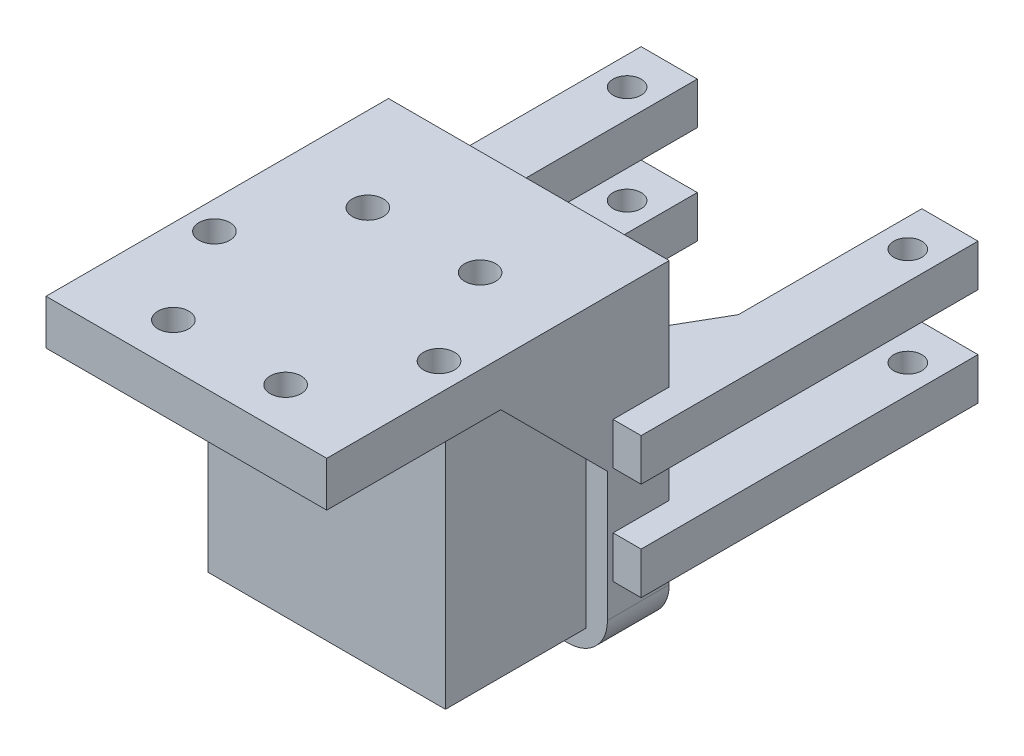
ISO-10303-21;
HEADER;
FILE_DESCRIPTION(('STEP AP214'),'2;1');
FILE_NAME('part.step','',(''),(''),'','','');
FILE_SCHEMA(('AUTOMOTIVE_DESIGN { 1 0 10303 214 1 1 1 1 }'));
ENDSEC;
DATA;
#1=APPLICATION_CONTEXT('core data for automotive mechanical design processes');
#2=APPLICATION_PROTOCOL_DEFINITION('international standard','automotive_design',2000,#1);
#3=PRODUCT_CONTEXT('',#1,'mechanical');
#4=PRODUCT('Part','Part','',(#3));
#5=PRODUCT_RELATED_PRODUCT_CATEGORY('part','',(#4));
#6=PRODUCT_DEFINITION_FORMATION('','',#4);
#7=PRODUCT_DEFINITION_CONTEXT('part definition',#1,'design');
#8=PRODUCT_DEFINITION('design','',#6,#7);
#9=PRODUCT_DEFINITION_SHAPE('','',#8);
#10=(LENGTH_UNIT() NAMED_UNIT(*) SI_UNIT(.MILLI.,.METRE.));
#11=(NAMED_UNIT(*) PLANE_ANGLE_UNIT() SI_UNIT($,.RADIAN.));
#12=(NAMED_UNIT(*) SI_UNIT($,.STERADIAN.) SOLID_ANGLE_UNIT());
#13=UNCERTAINTY_MEASURE_WITH_UNIT(LENGTH_MEASURE(1.E-05),#10,'distance_accuracy_value','');
#14=(GEOMETRIC_REPRESENTATION_CONTEXT(3) GLOBAL_UNCERTAINTY_ASSIGNED_CONTEXT((#13)) GLOBAL_UNIT_ASSIGNED_CONTEXT((#10,
#11,#12)) REPRESENTATION_CONTEXT('',''));
#15=CARTESIAN_POINT('',(0.,0.,0.));
#16=DIRECTION('',(0.,0.,1.));
#17=DIRECTION('',(1.,0.,0.));
#18=AXIS2_PLACEMENT_3D('',#15,#16,#17);
#19=CARTESIAN_POINT('',(0.,0.,23.));
#20=DIRECTION('',(0.,0.,1.));
#21=DIRECTION('',(1.,0.,0.));
#22=AXIS2_PLACEMENT_3D('',#19,#20,#21);
#23=PLANE('',#22);
#24=DIRECTION('',(0.,-1.,0.));
#25=VECTOR('',#24,1.);
#26=CARTESIAN_POINT('',(-21.15,21.15,23.));
#27=LINE('',#26,#25);
#28=CARTESIAN_POINT('',(-21.15,5.00000000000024,23.));
#29=VERTEX_POINT('',#28);
#30=CARTESIAN_POINT('',(-21.15,-21.15,23.));
#31=VERTEX_POINT('',#30);
#32=EDGE_CURVE('E429',#29,#31,#27,.T.);
#33=ORIENTED_EDGE('',*,*,#32,.F.);
#34=DIRECTION('',(-1.,0.,0.));
#35=VECTOR('',#34,1.);
#36=CARTESIAN_POINT('',(0.,5.00000000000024,23.));
#37=LINE('',#36,#35);
#38=CARTESIAN_POINT('',(-25.,5.00000000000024,23.));
#39=VERTEX_POINT('',#38);
#40=EDGE_CURVE('E781',#29,#39,#37,.T.);
#41=ORIENTED_EDGE('',*,*,#40,.T.);
#42=DIRECTION('',(0.,-1.,0.));
#43=VECTOR('',#42,1.);
#44=CARTESIAN_POINT('',(-25.,25.,23.));
#45=LINE('',#44,#43);
#46=CARTESIAN_POINT('',(-25.,-18.,23.));
#47=VERTEX_POINT('',#46);
#48=EDGE_CURVE('E96',#39,#47,#45,.T.);
#49=ORIENTED_EDGE('',*,*,#48,.T.);
#50=CARTESIAN_POINT('',(-18.,-18.,23.));
#51=DIRECTION('',(0.,0.,1.));
#52=DIRECTION('',(1.,0.,0.));
#53=AXIS2_PLACEMENT_3D('',#50,#51,#52);
#54=CIRCLE('',#53,7.);
#55=CARTESIAN_POINT('',(-18.,-25.,23.));
#56=VERTEX_POINT('',#55);
#57=EDGE_CURVE('E669',#47,#56,#54,.T.);
#58=ORIENTED_EDGE('',*,*,#57,.T.);
#59=DIRECTION('',(1.,0.,0.));
#60=VECTOR('',#59,1.);
#61=CARTESIAN_POINT('',(-25.,-25.,23.));
#62=LINE('',#61,#60);
#63=CARTESIAN_POINT('',(18.,-25.,23.));
#64=VERTEX_POINT('',#63);
#65=EDGE_CURVE('E650',#56,#64,#62,.T.);
#66=ORIENTED_EDGE('',*,*,#65,.T.);
#67=CARTESIAN_POINT('',(18.,-18.,23.));
#68=DIRECTION('',(0.,0.,1.));
#69=DIRECTION('',(1.,0.,0.));
#70=AXIS2_PLACEMENT_3D('',#67,#68,#69);
#71=CIRCLE('',#70,7.);
#72=CARTESIAN_POINT('',(25.,-18.,23.));
#73=VERTEX_POINT('',#72);
#74=EDGE_CURVE('E671',#64,#73,#71,.T.);
#75=ORIENTED_EDGE('',*,*,#74,.T.);
#76=DIRECTION('',(0.,1.,0.));
#77=VECTOR('',#76,1.);
#78=CARTESIAN_POINT('',(25.,25.,23.));
#79=LINE('',#78,#77);
#80=CARTESIAN_POINT('',(25.,5.00000000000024,23.));
#81=VERTEX_POINT('',#80);
#82=EDGE_CURVE('E633',#73,#81,#79,.T.);
#83=ORIENTED_EDGE('',*,*,#82,.T.);
#84=DIRECTION('',(1.,0.,0.));
#85=VECTOR('',#84,1.);
#86=CARTESIAN_POINT('',(0.,5.00000000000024,23.));
#87=LINE('',#86,#85);
#88=CARTESIAN_POINT('',(21.15,5.00000000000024,23.));
#89=VERTEX_POINT('',#88);
#90=EDGE_CURVE('E65',#81,#89,#87,.F.);
#91=ORIENTED_EDGE('',*,*,#90,.T.);
#92=DIRECTION('',(0.,1.,0.));
#93=VECTOR('',#92,1.);
#94=CARTESIAN_POINT('',(21.15,21.15,23.));
#95=LINE('',#94,#93);
#96=CARTESIAN_POINT('',(21.15,-21.15,23.));
#97=VERTEX_POINT('',#96);
#98=EDGE_CURVE('E72',#97,#89,#95,.T.);
#99=ORIENTED_EDGE('',*,*,#98,.F.);
#100=DIRECTION('',(1.,0.,0.));
#101=VECTOR('',#100,1.);
#102=CARTESIAN_POINT('',(-21.15,-21.15,23.));
#103=LINE('',#102,#101);
#104=EDGE_CURVE('E419',#31,#97,#103,.T.);
#105=ORIENTED_EDGE('',*,*,#104,.F.);
#106=EDGE_LOOP('',(#33,#41,#49,#58,#66,#75,#83,#91,#99,#105));
#107=FACE_BOUND('',#106,.T.);
#108=ADVANCED_FACE('F55',(#107),#23,.T.);
#109=DIRECTION('',(1.,0.,0.));
#110=VECTOR('',#109,1.);
#111=CARTESIAN_POINT('',(-25.,24.,23.));
#112=LINE('',#111,#110);
#113=CARTESIAN_POINT('',(-21.15,24.,23.));
#114=VERTEX_POINT('',#113);
#115=CARTESIAN_POINT('',(21.15,24.,23.));
#116=VERTEX_POINT('',#115);
#117=EDGE_CURVE('E374',#114,#116,#112,.T.);
#118=ORIENTED_EDGE('',*,*,#117,.F.);
#119=DIRECTION('',(0.,1.,0.));
#120=VECTOR('',#119,1.);
#121=CARTESIAN_POINT('',(-21.15,24.,23.));
#122=LINE('',#121,#120);
#123=CARTESIAN_POINT('',(-21.15,21.15,23.));
#124=VERTEX_POINT('',#123);
#125=EDGE_CURVE('E380',#124,#114,#122,.T.);
#126=ORIENTED_EDGE('',*,*,#125,.F.);
#127=DIRECTION('',(-1.,0.,0.));
#128=VECTOR('',#127,1.);
#129=CARTESIAN_POINT('',(-21.15,21.15,23.));
#130=LINE('',#129,#128);
#131=CARTESIAN_POINT('',(21.15,21.15,23.));
#132=VERTEX_POINT('',#131);
#133=EDGE_CURVE('E427',#132,#124,#130,.T.);
#134=ORIENTED_EDGE('',*,*,#133,.F.);
#135=DIRECTION('',(0.,-1.,0.));
#136=VECTOR('',#135,1.);
#137=CARTESIAN_POINT('',(21.15,24.,23.));
#138=LINE('',#137,#136);
#139=EDGE_CURVE('E389',#116,#132,#138,.T.);
#140=ORIENTED_EDGE('',*,*,#139,.F.);
#141=EDGE_LOOP('',(#118,#126,#134,#140));
#142=FACE_BOUND('',#141,.T.);
#143=ADVANCED_FACE('F392',(#142),#23,.T.);
#144=CARTESIAN_POINT('',(-21.15,21.15,48.));
#145=DIRECTION('',(1.,0.,0.));
#146=DIRECTION('',(0.,1.,0.));
#147=AXIS2_PLACEMENT_3D('',#144,#145,#146);
#148=PLANE('',#147);
#149=DIRECTION('',(0.,0.,-1.));
#150=VECTOR('',#149,1.);
#151=CARTESIAN_POINT('',(-21.15,21.15,48.));
#152=LINE('',#151,#150);
#153=CARTESIAN_POINT('',(-21.15,21.15,48.));
#154=VERTEX_POINT('',#153);
#155=CARTESIAN_POINT('',(-21.15,21.15,39.1499999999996));
#156=VERTEX_POINT('',#155);
#157=EDGE_CURVE('E437',#154,#156,#152,.T.);
#158=ORIENTED_EDGE('',*,*,#157,.T.);
#159=DIRECTION('',(0.,-0.707106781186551,-0.707106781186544));
#160=VECTOR('',#159,1.);
#161=CARTESIAN_POINT('',(-21.15,25.5750000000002,43.5749999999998));
#162=LINE('',#161,#160);
#163=EDGE_CURVE('E778',#156,#29,#162,.T.);
#164=ORIENTED_EDGE('',*,*,#163,.T.);
#165=ORIENTED_EDGE('',*,*,#32,.T.);
#166=DIRECTION('',(0.,0.,-1.));
#167=VECTOR('',#166,1.);
#168=CARTESIAN_POINT('',(-21.15,-21.15,48.));
#169=LINE('',#168,#167);
#170=CARTESIAN_POINT('',(-21.15,-21.15,48.));
#171=VERTEX_POINT('',#170);
#172=EDGE_CURVE('E434',#171,#31,#169,.T.);
#173=ORIENTED_EDGE('',*,*,#172,.F.);
#174=DIRECTION('',(0.,-1.,0.));
#175=VECTOR('',#174,1.);
#176=CARTESIAN_POINT('',(-21.15,21.15,48.));
#177=LINE('',#176,#175);
#178=EDGE_CURVE('E421',#154,#171,#177,.T.);
#179=ORIENTED_EDGE('',*,*,#178,.F.);
#180=EDGE_LOOP('',(#158,#164,#165,#173,#179));
#181=FACE_BOUND('',#180,.T.);
#182=ADVANCED_FACE('F827',(#181),#148,.F.);
#183=CARTESIAN_POINT('',(21.15,21.15,48.));
#184=DIRECTION('',(-1.,0.,0.));
#185=DIRECTION('',(0.,0.,1.));
#186=AXIS2_PLACEMENT_3D('',#183,#184,#185);
#187=PLANE('',#186);
#188=ORIENTED_EDGE('',*,*,#98,.T.);
#189=DIRECTION('',(0.,-0.707106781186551,-0.707106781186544));
#190=VECTOR('',#189,1.);
#191=CARTESIAN_POINT('',(21.15,25.5750000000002,43.5749999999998));
#192=LINE('',#191,#190);
#193=CARTESIAN_POINT('',(21.15,21.15,39.1499999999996));
#194=VERTEX_POINT('',#193);
#195=EDGE_CURVE('E11',#89,#194,#192,.F.);
#196=ORIENTED_EDGE('',*,*,#195,.T.);
#197=DIRECTION('',(0.,0.,-1.));
#198=VECTOR('',#197,1.);
#199=CARTESIAN_POINT('',(21.15,21.15,48.));
#200=LINE('',#199,#198);
#201=CARTESIAN_POINT('',(21.15,21.15,48.));
#202=VERTEX_POINT('',#201);
#203=EDGE_CURVE('E439',#202,#194,#200,.T.);
#204=ORIENTED_EDGE('',*,*,#203,.F.);
#205=DIRECTION('',(0.,1.,0.));
#206=VECTOR('',#205,1.);
#207=CARTESIAN_POINT('',(21.15,21.15,48.));
#208=LINE('',#207,#206);
#209=CARTESIAN_POINT('',(21.15,-21.15,48.));
#210=VERTEX_POINT('',#209);
#211=EDGE_CURVE('E415',#210,#202,#208,.T.);
#212=ORIENTED_EDGE('',*,*,#211,.F.);
#213=DIRECTION('',(0.,0.,-1.));
#214=VECTOR('',#213,1.);
#215=CARTESIAN_POINT('',(21.15,-21.15,48.));
#216=LINE('',#215,#214);
#217=EDGE_CURVE('E425',#210,#97,#216,.T.);
#218=ORIENTED_EDGE('',*,*,#217,.T.);
#219=EDGE_LOOP('',(#188,#196,#204,#212,#218));
#220=FACE_BOUND('',#219,.T.);
#221=ADVANCED_FACE('F796',(#220),#187,.F.);
#222=CARTESIAN_POINT('',(-25.,24.,73.));
#223=DIRECTION('',(0.,1.,0.));
#224=DIRECTION('',(0.,0.,1.));
#225=AXIS2_PLACEMENT_3D('',#222,#223,#224);
#226=PLANE('',#225);
#227=CARTESIAN_POINT('',(10.0000000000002,24.,65.3205080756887));
#228=DIRECTION('',(0.,1.,0.));
#229=DIRECTION('',(0.,0.,1.));
#230=AXIS2_PLACEMENT_3D('',#227,#228,#229);
#231=CIRCLE('',#230,2.75);
#232=CARTESIAN_POINT('',(10.0000000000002,24.,68.0705080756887));
#233=VERTEX_POINT('',#232);
#234=EDGE_CURVE('E872',#233,#233,#231,.F.);
#235=ORIENTED_EDGE('',*,*,#234,.F.);
#236=EDGE_LOOP('',(#235));
#237=FACE_BOUND('',#236,.T.);
#238=CARTESIAN_POINT('',(-9.99999999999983,24.,65.3205080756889));
#239=DIRECTION('',(0.,1.,0.));
#240=DIRECTION('',(0.,0.,1.));
#241=AXIS2_PLACEMENT_3D('',#238,#239,#240);
#242=CIRCLE('',#241,2.75);
#243=CARTESIAN_POINT('',(-9.99999999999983,24.,68.0705080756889));
#244=VERTEX_POINT('',#243);
#245=EDGE_CURVE('E879',#244,#244,#242,.F.);
#246=ORIENTED_EDGE('',*,*,#245,.F.);
#247=EDGE_LOOP('',(#246));
#248=FACE_BOUND('',#247,.T.);
#249=CARTESIAN_POINT('',(-20.,24.,48.));
#250=DIRECTION('',(0.,1.,0.));
#251=DIRECTION('',(0.,0.,1.));
#252=AXIS2_PLACEMENT_3D('',#249,#250,#251);
#253=CIRCLE('',#252,2.75);
#254=CARTESIAN_POINT('',(-20.,24.,50.75));
#255=VERTEX_POINT('',#254);
#256=EDGE_CURVE('E887',#255,#255,#253,.F.);
#257=ORIENTED_EDGE('',*,*,#256,.F.);
#258=EDGE_LOOP('',(#257));
#259=FACE_BOUND('',#258,.T.);
#260=CARTESIAN_POINT('',(-10.0000000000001,24.,30.6794919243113));
#261=DIRECTION('',(0.,1.,0.));
#262=DIRECTION('',(0.,0.,1.));
#263=AXIS2_PLACEMENT_3D('',#260,#261,#262);
#264=CIRCLE('',#263,2.75);
#265=CARTESIAN_POINT('',(-10.0000000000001,24.,33.4294919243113));
#266=VERTEX_POINT('',#265);
#267=EDGE_CURVE('E869',#266,#266,#264,.F.);
#268=ORIENTED_EDGE('',*,*,#267,.F.);
#269=EDGE_LOOP('',(#268));
#270=FACE_BOUND('',#269,.T.);
#271=CARTESIAN_POINT('',(9.99999999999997,24.,30.6794919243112));
#272=DIRECTION('',(0.,1.,0.));
#273=DIRECTION('',(0.,0.,1.));
#274=AXIS2_PLACEMENT_3D('',#271,#272,#273);
#275=CIRCLE('',#274,2.75);
#276=CARTESIAN_POINT('',(9.99999999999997,24.,33.4294919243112));
#277=VERTEX_POINT('',#276);
#278=EDGE_CURVE('E864',#277,#277,#275,.F.);
#279=ORIENTED_EDGE('',*,*,#278,.F.);
#280=EDGE_LOOP('',(#279));
#281=FACE_BOUND('',#280,.T.);
#282=CARTESIAN_POINT('',(20.,24.,48.));
#283=DIRECTION('',(0.,1.,0.));
#284=DIRECTION('',(0.,0.,1.));
#285=AXIS2_PLACEMENT_3D('',#282,#283,#284);
#286=CIRCLE('',#285,2.75);
#287=CARTESIAN_POINT('',(20.,24.,50.75));
#288=VERTEX_POINT('',#287);
#289=EDGE_CURVE('E858',#288,#288,#286,.F.);
#290=ORIENTED_EDGE('',*,*,#289,.F.);
#291=EDGE_LOOP('',(#290));
#292=FACE_BOUND('',#291,.T.);
#293=DIRECTION('',(0.,0.,-1.));
#294=VECTOR('',#293,1.);
#295=CARTESIAN_POINT('',(-25.,24.,73.));
#296=LINE('',#295,#294);
#297=CARTESIAN_POINT('',(-25.,24.,73.));
#298=VERTEX_POINT('',#297);
#299=CARTESIAN_POINT('',(-25.,24.,41.9999999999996));
#300=VERTEX_POINT('',#299);
#301=EDGE_CURVE('E87',#298,#300,#296,.T.);
#302=ORIENTED_EDGE('',*,*,#301,.T.);
#303=DIRECTION('',(1.,0.,0.));
#304=VECTOR('',#303,1.);
#305=CARTESIAN_POINT('',(-25.,24.,41.9999999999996));
#306=LINE('',#305,#304);
#307=CARTESIAN_POINT('',(-21.15,24.,41.9999999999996));
#308=VERTEX_POINT('',#307);
#309=EDGE_CURVE('E376',#300,#308,#306,.T.);
#310=ORIENTED_EDGE('',*,*,#309,.T.);
#311=DIRECTION('',(0.,0.,-1.));
#312=VECTOR('',#311,1.);
#313=CARTESIAN_POINT('',(-21.15,24.,43.));
#314=LINE('',#313,#312);
#315=EDGE_CURVE('E369',#308,#114,#314,.T.);
#316=ORIENTED_EDGE('',*,*,#315,.T.);
#317=ORIENTED_EDGE('',*,*,#117,.T.);
#318=DIRECTION('',(0.,0.,-1.));
#319=VECTOR('',#318,1.);
#320=CARTESIAN_POINT('',(21.15,24.,43.));
#321=LINE('',#320,#319);
#322=CARTESIAN_POINT('',(21.15,24.,41.9999999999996));
#323=VERTEX_POINT('',#322);
#324=EDGE_CURVE('E857',#323,#116,#321,.T.);
#325=ORIENTED_EDGE('',*,*,#324,.F.);
#326=DIRECTION('',(-1.,0.,0.));
#327=VECTOR('',#326,1.);
#328=CARTESIAN_POINT('',(-25.,24.,41.9999999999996));
#329=LINE('',#328,#327);
#330=CARTESIAN_POINT('',(25.,24.,41.9999999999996));
#331=VERTEX_POINT('',#330);
#332=EDGE_CURVE('E783',#323,#331,#329,.F.);
#333=ORIENTED_EDGE('',*,*,#332,.T.);
#334=DIRECTION('',(0.,0.,-1.));
#335=VECTOR('',#334,1.);
#336=CARTESIAN_POINT('',(25.,24.,73.));
#337=LINE('',#336,#335);
#338=CARTESIAN_POINT('',(25.,24.,73.));
#339=VERTEX_POINT('',#338);
#340=EDGE_CURVE('E404',#339,#331,#337,.T.);
#341=ORIENTED_EDGE('',*,*,#340,.F.);
#342=DIRECTION('',(1.,0.,0.));
#343=VECTOR('',#342,1.);
#344=CARTESIAN_POINT('',(-25.,24.,73.));
#345=LINE('',#344,#343);
#346=EDGE_CURVE('E397',#298,#339,#345,.T.);
#347=ORIENTED_EDGE('',*,*,#346,.F.);
#348=EDGE_LOOP('',(#302,#310,#316,#317,#325,#333,#341,#347));
#349=FACE_BOUND('',#348,.T.);
#350=ADVANCED_FACE('F371',(#237,#248,#259,#270,#281,#292,#349),#226,.F.);
#351=CARTESIAN_POINT('',(0.,0.,12.));
#352=DIRECTION('',(0.,0.,-1.));
#353=DIRECTION('',(-1.,0.,0.));
#354=AXIS2_PLACEMENT_3D('',#351,#352,#353);
#355=PLANE('',#354);
#356=CARTESIAN_POINT('',(15.5,-15.5,12.));
#357=DIRECTION('',(0.,0.,-1.));
#358=DIRECTION('',(-1.,0.,0.));
#359=AXIS2_PLACEMENT_3D('',#356,#357,#358);
#360=CIRCLE('',#359,1.5);
#361=CARTESIAN_POINT('',(14.,-15.5,12.));
#362=VERTEX_POINT('',#361);
#363=EDGE_CURVE('E605',#362,#362,#360,.F.);
#364=ORIENTED_EDGE('',*,*,#363,.T.);
#365=EDGE_LOOP('',(#364));
#366=FACE_BOUND('',#365,.T.);
#367=CARTESIAN_POINT('',(-15.5,-15.5,12.));
#368=DIRECTION('',(0.,0.,-1.));
#369=DIRECTION('',(-1.,0.,0.));
#370=AXIS2_PLACEMENT_3D('',#367,#368,#369);
#371=CIRCLE('',#370,1.5);
#372=CARTESIAN_POINT('',(-17.,-15.5,12.));
#373=VERTEX_POINT('',#372);
#374=EDGE_CURVE('E609',#373,#373,#371,.F.);
#375=ORIENTED_EDGE('',*,*,#374,.T.);
#376=EDGE_LOOP('',(#375));
#377=FACE_BOUND('',#376,.T.);
#378=DIRECTION('',(-1.,0.,0.));
#379=VECTOR('',#378,1.);
#380=CARTESIAN_POINT('',(0.,-12.5,12.));
#381=LINE('',#380,#379);
#382=CARTESIAN_POINT('',(-9.99999999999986,-12.5,12.));
#383=VERTEX_POINT('',#382);
#384=CARTESIAN_POINT('',(-25.,-12.5,12.));
#385=VERTEX_POINT('',#384);
#386=EDGE_CURVE('E680',#383,#385,#381,.T.);
#387=ORIENTED_EDGE('',*,*,#386,.F.);
#388=DIRECTION('',(0.,1.,0.));
#389=VECTOR('',#388,1.);
#390=CARTESIAN_POINT('',(-9.99999999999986,-5.,12.));
#391=LINE('',#390,#389);
#392=CARTESIAN_POINT('',(-9.99999999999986,-11.8427192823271,12.));
#393=VERTEX_POINT('',#392);
#394=EDGE_CURVE('E716',#383,#393,#391,.T.);
#395=ORIENTED_EDGE('',*,*,#394,.T.);
#396=CARTESIAN_POINT('',(0.,0.,12.));
#397=DIRECTION('',(0.,0.,-1.));
#398=DIRECTION('',(-1.,0.,0.));
#399=AXIS2_PLACEMENT_3D('',#396,#397,#398);
#400=CIRCLE('',#399,15.5);
#401=CARTESIAN_POINT('',(9.99999999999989,-11.8427192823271,12.));
#402=VERTEX_POINT('',#401);
#403=EDGE_CURVE('E601',#402,#393,#400,.T.);
#404=ORIENTED_EDGE('',*,*,#403,.F.);
#405=DIRECTION('',(0.,-1.,0.));
#406=VECTOR('',#405,1.);
#407=CARTESIAN_POINT('',(9.99999999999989,-12.5,12.));
#408=LINE('',#407,#406);
#409=CARTESIAN_POINT('',(9.99999999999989,-12.5,12.));
#410=VERTEX_POINT('',#409);
#411=EDGE_CURVE('E710',#402,#410,#408,.T.);
#412=ORIENTED_EDGE('',*,*,#411,.T.);
#413=DIRECTION('',(-1.,0.,0.));
#414=VECTOR('',#413,1.);
#415=CARTESIAN_POINT('',(0.,-12.5,12.));
#416=LINE('',#415,#414);
#417=CARTESIAN_POINT('',(25.,-12.5,12.));
#418=VERTEX_POINT('',#417);
#419=EDGE_CURVE('E693',#418,#410,#416,.T.);
#420=ORIENTED_EDGE('',*,*,#419,.F.);
#421=DIRECTION('',(0.,-1.,0.));
#422=VECTOR('',#421,1.);
#423=CARTESIAN_POINT('',(25.,25.,12.));
#424=LINE('',#423,#422);
#425=CARTESIAN_POINT('',(25.,-18.,12.));
#426=VERTEX_POINT('',#425);
#427=EDGE_CURVE('E621',#418,#426,#424,.T.);
#428=ORIENTED_EDGE('',*,*,#427,.T.);
#429=CARTESIAN_POINT('',(18.,-18.,12.));
#430=DIRECTION('',(0.,0.,-1.));
#431=DIRECTION('',(-1.,0.,0.));
#432=AXIS2_PLACEMENT_3D('',#429,#430,#431);
#433=CIRCLE('',#432,7.);
#434=CARTESIAN_POINT('',(18.,-25.,12.));
#435=VERTEX_POINT('',#434);
#436=EDGE_CURVE('E662',#426,#435,#433,.T.);
#437=ORIENTED_EDGE('',*,*,#436,.T.);
#438=DIRECTION('',(-1.,0.,0.));
#439=VECTOR('',#438,1.);
#440=CARTESIAN_POINT('',(-25.,-25.,12.));
#441=LINE('',#440,#439);
#442=CARTESIAN_POINT('',(-18.,-25.,12.));
#443=VERTEX_POINT('',#442);
#444=EDGE_CURVE('E615',#435,#443,#441,.T.);
#445=ORIENTED_EDGE('',*,*,#444,.T.);
#446=CARTESIAN_POINT('',(-18.,-18.,12.));
#447=DIRECTION('',(0.,0.,-1.));
#448=DIRECTION('',(-1.,0.,0.));
#449=AXIS2_PLACEMENT_3D('',#446,#447,#448);
#450=CIRCLE('',#449,7.);
#451=CARTESIAN_POINT('',(-25.,-18.,12.));
#452=VERTEX_POINT('',#451);
#453=EDGE_CURVE('E660',#443,#452,#450,.T.);
#454=ORIENTED_EDGE('',*,*,#453,.T.);
#455=DIRECTION('',(0.,1.,0.));
#456=VECTOR('',#455,1.);
#457=CARTESIAN_POINT('',(-25.,25.,12.));
#458=LINE('',#457,#456);
#459=EDGE_CURVE('E619',#452,#385,#458,.T.);
#460=ORIENTED_EDGE('',*,*,#459,.T.);
#461=EDGE_LOOP('',(#387,#395,#404,#412,#420,#428,#437,#445,#454,#460));
#462=FACE_BOUND('',#461,.T.);
#463=ADVANCED_FACE('F846',(#366,#377,#462),#355,.T.);
#464=CARTESIAN_POINT('',(-14.6714007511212,-5.00000000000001,12.));
#465=VERTEX_POINT('',#464);
#466=CARTESIAN_POINT('',(-14.6714007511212,4.99999999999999,12.));
#467=VERTEX_POINT('',#466);
#468=EDGE_CURVE('E598',#465,#467,#400,.T.);
#469=ORIENTED_EDGE('',*,*,#468,.F.);
#470=DIRECTION('',(1.,0.,0.));
#471=VECTOR('',#470,1.);
#472=CARTESIAN_POINT('',(0.,-5.00000000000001,12.));
#473=LINE('',#472,#471);
#474=CARTESIAN_POINT('',(-25.,-5.00000000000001,12.));
#475=VERTEX_POINT('',#474);
#476=EDGE_CURVE('E683',#475,#465,#473,.T.);
#477=ORIENTED_EDGE('',*,*,#476,.F.);
#478=CARTESIAN_POINT('',(-25.,4.99999999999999,12.));
#479=VERTEX_POINT('',#478);
#480=EDGE_CURVE('E622',#475,#479,#458,.T.);
#481=ORIENTED_EDGE('',*,*,#480,.T.);
#482=DIRECTION('',(-1.,0.,0.));
#483=VECTOR('',#482,1.);
#484=CARTESIAN_POINT('',(0.,4.99999999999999,12.));
#485=LINE('',#484,#483);
#486=EDGE_CURVE('E687',#467,#479,#485,.T.);
#487=ORIENTED_EDGE('',*,*,#486,.F.);
#488=EDGE_LOOP('',(#469,#477,#481,#487));
#489=FACE_BOUND('',#488,.T.);
#490=ADVANCED_FACE('F1147',(#489),#355,.T.);
#491=DIRECTION('',(1.,0.,0.));
#492=VECTOR('',#491,1.);
#493=CARTESIAN_POINT('',(0.,-5.00000000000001,12.));
#494=LINE('',#493,#492);
#495=CARTESIAN_POINT('',(14.6714007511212,-5.00000000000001,12.));
#496=VERTEX_POINT('',#495);
#497=CARTESIAN_POINT('',(25.,-5.00000000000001,12.));
#498=VERTEX_POINT('',#497);
#499=EDGE_CURVE('E690',#496,#498,#494,.T.);
#500=ORIENTED_EDGE('',*,*,#499,.F.);
#501=CARTESIAN_POINT('',(14.6714007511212,4.99999999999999,12.));
#502=VERTEX_POINT('',#501);
#503=EDGE_CURVE('E1189',#502,#496,#400,.T.);
#504=ORIENTED_EDGE('',*,*,#503,.F.);
#505=DIRECTION('',(-1.,0.,0.));
#506=VECTOR('',#505,1.);
#507=CARTESIAN_POINT('',(0.,4.99999999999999,12.));
#508=LINE('',#507,#506);
#509=CARTESIAN_POINT('',(25.,4.99999999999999,12.));
#510=VERTEX_POINT('',#509);
#511=EDGE_CURVE('E675',#510,#502,#508,.T.);
#512=ORIENTED_EDGE('',*,*,#511,.F.);
#513=EDGE_CURVE('E626',#510,#498,#424,.T.);
#514=ORIENTED_EDGE('',*,*,#513,.T.);
#515=EDGE_LOOP('',(#500,#504,#512,#514));
#516=FACE_BOUND('',#515,.T.);
#517=ADVANCED_FACE('F938',(#516),#355,.T.);
#518=CARTESIAN_POINT('',(25.,25.,23.));
#519=DIRECTION('',(-1.,0.,0.));
#520=DIRECTION('',(0.,-1.,0.));
#521=AXIS2_PLACEMENT_3D('',#518,#519,#520);
#522=PLANE('',#521);
#523=ORIENTED_EDGE('',*,*,#340,.T.);
#524=DIRECTION('',(0.,0.707106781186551,0.707106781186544));
#525=VECTOR('',#524,1.);
#526=CARTESIAN_POINT('',(25.,25.0000000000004,43.));
#527=LINE('',#526,#525);
#528=EDGE_CURVE('E771',#331,#81,#527,.F.);
#529=ORIENTED_EDGE('',*,*,#528,.T.);
#530=ORIENTED_EDGE('',*,*,#82,.F.);
#531=DIRECTION('',(0.,0.,-1.));
#532=VECTOR('',#531,1.);
#533=CARTESIAN_POINT('',(25.,-18.,23.));
#534=LINE('',#533,#532);
#535=EDGE_CURVE('E653',#73,#426,#534,.T.);
#536=ORIENTED_EDGE('',*,*,#535,.T.);
#537=ORIENTED_EDGE('',*,*,#427,.F.);
#538=DIRECTION('',(0.,0.,1.));
#539=VECTOR('',#538,1.);
#540=CARTESIAN_POINT('',(25.,-12.5,23.));
#541=LINE('',#540,#539);
#542=CARTESIAN_POINT('',(25.,-12.5,22.));
#543=VERTEX_POINT('',#542);
#544=EDGE_CURVE('E595',#418,#543,#541,.T.);
#545=ORIENTED_EDGE('',*,*,#544,.T.);
#546=DIRECTION('',(0.,1.,0.));
#547=VECTOR('',#546,1.);
#548=CARTESIAN_POINT('',(25.,25.,22.));
#549=LINE('',#548,#547);
#550=CARTESIAN_POINT('',(25.,-5.00000000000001,22.));
#551=VERTEX_POINT('',#550);
#552=EDGE_CURVE('E701',#543,#551,#549,.T.);
#553=ORIENTED_EDGE('',*,*,#552,.T.);
#554=DIRECTION('',(0.,0.,-1.));
#555=VECTOR('',#554,1.);
#556=CARTESIAN_POINT('',(25.,-5.00000000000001,23.));
#557=LINE('',#556,#555);
#558=EDGE_CURVE('E592',#551,#498,#557,.T.);
#559=ORIENTED_EDGE('',*,*,#558,.T.);
#560=ORIENTED_EDGE('',*,*,#513,.F.);
#561=DIRECTION('',(0.,0.,1.));
#562=VECTOR('',#561,1.);
#563=CARTESIAN_POINT('',(25.,4.99999999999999,23.));
#564=LINE('',#563,#562);
#565=CARTESIAN_POINT('',(25.,4.99999999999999,22.));
#566=VERTEX_POINT('',#565);
#567=EDGE_CURVE('E573',#510,#566,#564,.T.);
#568=ORIENTED_EDGE('',*,*,#567,.T.);
#569=DIRECTION('',(0.,1.,0.));
#570=VECTOR('',#569,1.);
#571=CARTESIAN_POINT('',(25.,25.,22.));
#572=LINE('',#571,#570);
#573=CARTESIAN_POINT('',(25.,12.5,22.));
#574=VERTEX_POINT('',#573);
#575=EDGE_CURVE('E699',#566,#574,#572,.T.);
#576=ORIENTED_EDGE('',*,*,#575,.T.);
#577=DIRECTION('',(0.,0.,-1.));
#578=VECTOR('',#577,1.);
#579=CARTESIAN_POINT('',(25.,12.5,23.));
#580=LINE('',#579,#578);
#581=CARTESIAN_POINT('',(25.,12.5,12.));
#582=VERTEX_POINT('',#581);
#583=EDGE_CURVE('E580',#574,#582,#580,.T.);
#584=ORIENTED_EDGE('',*,*,#583,.T.);
#585=CARTESIAN_POINT('',(25.,32.,12.));
#586=VERTEX_POINT('',#585);
#587=EDGE_CURVE('E623',#586,#582,#424,.T.);
#588=ORIENTED_EDGE('',*,*,#587,.F.);
#589=DIRECTION('',(0.,0.,-1.));
#590=VECTOR('',#589,1.);
#591=CARTESIAN_POINT('',(25.,32.,23.));
#592=LINE('',#591,#590);
#593=CARTESIAN_POINT('',(25.,32.,73.));
#594=VERTEX_POINT('',#593);
#595=EDGE_CURVE('E409',#594,#586,#592,.T.);
#596=ORIENTED_EDGE('',*,*,#595,.F.);
#597=DIRECTION('',(0.,1.,0.));
#598=VECTOR('',#597,1.);
#599=CARTESIAN_POINT('',(25.,32.,73.));
#600=LINE('',#599,#598);
#601=EDGE_CURVE('E805',#339,#594,#600,.T.);
#602=ORIENTED_EDGE('',*,*,#601,.F.);
#603=EDGE_LOOP('',(#523,#529,#530,#536,#537,#545,#553,#559,#560,#568,#576,#584,#588,#596,#602));
#604=FACE_BOUND('',#603,.T.);
#605=ADVANCED_FACE('F854',(#604),#522,.F.);
#606=CARTESIAN_POINT('',(-25.,25.,23.));
#607=DIRECTION('',(1.,0.,0.));
#608=DIRECTION('',(0.,1.,0.));
#609=AXIS2_PLACEMENT_3D('',#606,#607,#608);
#610=PLANE('',#609);
#611=ORIENTED_EDGE('',*,*,#48,.F.);
#612=DIRECTION('',(0.,0.707106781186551,0.707106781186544));
#613=VECTOR('',#612,1.);
#614=CARTESIAN_POINT('',(-25.,25.0000000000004,43.));
#615=LINE('',#614,#613);
#616=EDGE_CURVE('E769',#39,#300,#615,.T.);
#617=ORIENTED_EDGE('',*,*,#616,.T.);
#618=ORIENTED_EDGE('',*,*,#301,.F.);
#619=DIRECTION('',(0.,-1.,0.));
#620=VECTOR('',#619,1.);
#621=CARTESIAN_POINT('',(-25.,32.,73.));
#622=LINE('',#621,#620);
#623=CARTESIAN_POINT('',(-25.,32.,73.));
#624=VERTEX_POINT('',#623);
#625=EDGE_CURVE('E394',#624,#298,#622,.T.);
#626=ORIENTED_EDGE('',*,*,#625,.F.);
#627=DIRECTION('',(0.,0.,1.));
#628=VECTOR('',#627,1.);
#629=CARTESIAN_POINT('',(-25.,32.,23.));
#630=LINE('',#629,#628);
#631=CARTESIAN_POINT('',(-25.,32.,12.));
#632=VERTEX_POINT('',#631);
#633=EDGE_CURVE('E407',#632,#624,#630,.T.);
#634=ORIENTED_EDGE('',*,*,#633,.F.);
#635=CARTESIAN_POINT('',(-25.,12.5,12.));
#636=VERTEX_POINT('',#635);
#637=EDGE_CURVE('E618',#636,#632,#458,.T.);
#638=ORIENTED_EDGE('',*,*,#637,.F.);
#639=DIRECTION('',(0.,0.,1.));
#640=VECTOR('',#639,1.);
#641=CARTESIAN_POINT('',(-25.,12.5,23.));
#642=LINE('',#641,#640);
#643=CARTESIAN_POINT('',(-25.,12.5,22.));
#644=VERTEX_POINT('',#643);
#645=EDGE_CURVE('E588',#636,#644,#642,.T.);
#646=ORIENTED_EDGE('',*,*,#645,.T.);
#647=DIRECTION('',(0.,-1.,0.));
#648=VECTOR('',#647,1.);
#649=CARTESIAN_POINT('',(-25.,25.,22.));
#650=LINE('',#649,#648);
#651=CARTESIAN_POINT('',(-25.,4.99999999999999,22.));
#652=VERTEX_POINT('',#651);
#653=EDGE_CURVE('E697',#644,#652,#650,.T.);
#654=ORIENTED_EDGE('',*,*,#653,.T.);
#655=DIRECTION('',(0.,0.,-1.));
#656=VECTOR('',#655,1.);
#657=CARTESIAN_POINT('',(-25.,4.99999999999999,23.));
#658=LINE('',#657,#656);
#659=EDGE_CURVE('E590',#652,#479,#658,.T.);
#660=ORIENTED_EDGE('',*,*,#659,.T.);
#661=ORIENTED_EDGE('',*,*,#480,.F.);
#662=DIRECTION('',(0.,0.,1.));
#663=VECTOR('',#662,1.);
#664=CARTESIAN_POINT('',(-25.,-5.00000000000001,23.));
#665=LINE('',#664,#663);
#666=CARTESIAN_POINT('',(-25.,-5.00000000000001,22.));
#667=VERTEX_POINT('',#666);
#668=EDGE_CURVE('E586',#475,#667,#665,.T.);
#669=ORIENTED_EDGE('',*,*,#668,.T.);
#670=DIRECTION('',(0.,-1.,0.));
#671=VECTOR('',#670,1.);
#672=CARTESIAN_POINT('',(-25.,25.,22.));
#673=LINE('',#672,#671);
#674=CARTESIAN_POINT('',(-25.,-12.5,22.));
#675=VERTEX_POINT('',#674);
#676=EDGE_CURVE('E695',#667,#675,#673,.T.);
#677=ORIENTED_EDGE('',*,*,#676,.T.);
#678=DIRECTION('',(0.,0.,-1.));
#679=VECTOR('',#678,1.);
#680=CARTESIAN_POINT('',(-25.,-12.5,23.));
#681=LINE('',#680,#679);
#682=EDGE_CURVE('E583',#675,#385,#681,.T.);
#683=ORIENTED_EDGE('',*,*,#682,.T.);
#684=ORIENTED_EDGE('',*,*,#459,.F.);
#685=DIRECTION('',(0.,0.,-1.));
#686=VECTOR('',#685,1.);
#687=CARTESIAN_POINT('',(-25.,-18.,23.));
#688=LINE('',#687,#686);
#689=EDGE_CURVE('E673',#452,#47,#688,.F.);
#690=ORIENTED_EDGE('',*,*,#689,.T.);
#691=EDGE_LOOP('',(#611,#617,#618,#626,#634,#638,#646,#654,#660,#661,#669,#677,#683,#684,#690));
#692=FACE_BOUND('',#691,.T.);
#693=ADVANCED_FACE('F815',(#692),#610,.F.);
#694=CARTESIAN_POINT('',(-25.,-25.,23.));
#695=DIRECTION('',(0.,1.,0.));
#696=DIRECTION('',(0.,0.,1.));
#697=AXIS2_PLACEMENT_3D('',#694,#695,#696);
#698=PLANE('',#697);
#699=ORIENTED_EDGE('',*,*,#444,.F.);
#700=DIRECTION('',(0.,0.,-1.));
#701=VECTOR('',#700,1.);
#702=CARTESIAN_POINT('',(18.,-25.,23.));
#703=LINE('',#702,#701);
#704=EDGE_CURVE('E667',#435,#64,#703,.F.);
#705=ORIENTED_EDGE('',*,*,#704,.T.);
#706=ORIENTED_EDGE('',*,*,#65,.F.);
#707=DIRECTION('',(0.,0.,-1.));
#708=VECTOR('',#707,1.);
#709=CARTESIAN_POINT('',(-18.,-25.,23.));
#710=LINE('',#709,#708);
#711=EDGE_CURVE('E664',#56,#443,#710,.T.);
#712=ORIENTED_EDGE('',*,*,#711,.T.);
#713=EDGE_LOOP('',(#699,#705,#706,#712));
#714=FACE_BOUND('',#713,.T.);
#715=ADVANCED_FACE('F843',(#714),#698,.F.);
#716=CARTESIAN_POINT('',(0.,0.,0.));
#717=DIRECTION('',(0.,0.,1.));
#718=DIRECTION('',(1.,0.,0.));
#719=AXIS2_PLACEMENT_3D('',#716,#717,#718);
#720=PLANE('',#719);
#721=CARTESIAN_POINT('',(0.,0.,0.));
#722=DIRECTION('',(0.,0.,-1.));
#723=DIRECTION('',(-1.,0.,0.));
#724=AXIS2_PLACEMENT_3D('',#721,#722,#723);
#725=CIRCLE('',#724,10.);
#726=CARTESIAN_POINT('',(-9.99999999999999,0.,0.));
#727=VERTEX_POINT('',#726);
#728=EDGE_CURVE('E625',#727,#727,#725,.T.);
#729=ORIENTED_EDGE('',*,*,#728,.F.);
#730=EDGE_LOOP('',(#729));
#731=FACE_BOUND('',#730,.T.);
#732=CARTESIAN_POINT('',(0.,0.,0.));
#733=DIRECTION('',(0.,0.,-1.));
#734=DIRECTION('',(-1.,0.,0.));
#735=AXIS2_PLACEMENT_3D('',#732,#733,#734);
#736=CIRCLE('',#735,15.5);
#737=CARTESIAN_POINT('',(-15.5,0.,0.));
#738=VERTEX_POINT('',#737);
#739=EDGE_CURVE('E597',#738,#738,#736,.T.);
#740=ORIENTED_EDGE('',*,*,#739,.T.);
#741=EDGE_LOOP('',(#740));
#742=FACE_BOUND('',#741,.T.);
#743=ADVANCED_FACE('F928',(#731,#742),#720,.F.);
#744=CARTESIAN_POINT('',(-15.5,15.5,0.));
#745=DIRECTION('',(0.,0.,1.));
#746=DIRECTION('',(1.,0.,0.));
#747=AXIS2_PLACEMENT_3D('',#744,#745,#746);
#748=CYLINDRICAL_SURFACE('',#747,1.5);
#749=CARTESIAN_POINT('',(-15.5,15.5,23.));
#750=DIRECTION('',(0.,0.,1.));
#751=DIRECTION('',(1.,0.,0.));
#752=AXIS2_PLACEMENT_3D('',#749,#750,#751);
#753=CIRCLE('',#752,1.5);
#754=CARTESIAN_POINT('',(-14.,15.5,23.));
#755=VERTEX_POINT('',#754);
#756=EDGE_CURVE('E441',#755,#755,#753,.T.);
#757=ORIENTED_EDGE('',*,*,#756,.T.);
#758=EDGE_LOOP('',(#757));
#759=FACE_BOUND('',#758,.T.);
#760=CARTESIAN_POINT('',(-15.5,15.5,12.));
#761=DIRECTION('',(0.,0.,-1.));
#762=DIRECTION('',(-1.,0.,0.));
#763=AXIS2_PLACEMENT_3D('',#760,#761,#762);
#764=CIRCLE('',#763,1.5);
#765=CARTESIAN_POINT('',(-17.,15.5,12.));
#766=VERTEX_POINT('',#765);
#767=EDGE_CURVE('E612',#766,#766,#764,.F.);
#768=ORIENTED_EDGE('',*,*,#767,.F.);
#769=EDGE_LOOP('',(#768));
#770=FACE_BOUND('',#769,.T.);
#771=ADVANCED_FACE('F926',(#759,#770),#748,.F.);
#772=CARTESIAN_POINT('',(15.5,15.5,0.));
#773=DIRECTION('',(0.,0.,1.));
#774=DIRECTION('',(1.,0.,0.));
#775=AXIS2_PLACEMENT_3D('',#772,#773,#774);
#776=CYLINDRICAL_SURFACE('',#775,1.5);
#777=CARTESIAN_POINT('',(15.5,15.5,23.));
#778=DIRECTION('',(0.,0.,1.));
#779=DIRECTION('',(1.,0.,0.));
#780=AXIS2_PLACEMENT_3D('',#777,#778,#779);
#781=CIRCLE('',#780,1.5);
#782=CARTESIAN_POINT('',(17.,15.5,23.));
#783=VERTEX_POINT('',#782);
#784=EDGE_CURVE('E637',#783,#783,#781,.T.);
#785=ORIENTED_EDGE('',*,*,#784,.T.);
#786=EDGE_LOOP('',(#785));
#787=FACE_BOUND('',#786,.T.);
#788=CARTESIAN_POINT('',(15.5,15.5,12.));
#789=DIRECTION('',(0.,0.,-1.));
#790=DIRECTION('',(-1.,0.,0.));
#791=AXIS2_PLACEMENT_3D('',#788,#789,#790);
#792=CIRCLE('',#791,1.5);
#793=CARTESIAN_POINT('',(14.,15.5,12.));
#794=VERTEX_POINT('',#793);
#795=EDGE_CURVE('E608',#794,#794,#792,.F.);
#796=ORIENTED_EDGE('',*,*,#795,.F.);
#797=EDGE_LOOP('',(#796));
#798=FACE_BOUND('',#797,.T.);
#799=ADVANCED_FACE('F1131',(#787,#798),#776,.F.);
#800=CARTESIAN_POINT('',(15.5,-15.5,0.));
#801=DIRECTION('',(0.,0.,1.));
#802=DIRECTION('',(1.,0.,0.));
#803=AXIS2_PLACEMENT_3D('',#800,#801,#802);
#804=CYLINDRICAL_SURFACE('',#803,1.5);
#805=CARTESIAN_POINT('',(15.5,-15.5,23.));
#806=DIRECTION('',(0.,0.,1.));
#807=DIRECTION('',(1.,0.,0.));
#808=AXIS2_PLACEMENT_3D('',#805,#806,#807);
#809=CIRCLE('',#808,1.5);
#810=CARTESIAN_POINT('',(17.,-15.5,23.));
#811=VERTEX_POINT('',#810);
#812=EDGE_CURVE('E640',#811,#811,#809,.T.);
#813=ORIENTED_EDGE('',*,*,#812,.T.);
#814=EDGE_LOOP('',(#813));
#815=FACE_BOUND('',#814,.T.);
#816=ORIENTED_EDGE('',*,*,#363,.F.);
#817=EDGE_LOOP('',(#816));
#818=FACE_BOUND('',#817,.T.);
#819=ADVANCED_FACE('F1134',(#815,#818),#804,.F.);
#820=CARTESIAN_POINT('',(-15.5,-15.5,0.));
#821=DIRECTION('',(0.,0.,1.));
#822=DIRECTION('',(1.,0.,0.));
#823=AXIS2_PLACEMENT_3D('',#820,#821,#822);
#824=CYLINDRICAL_SURFACE('',#823,1.5);
#825=CARTESIAN_POINT('',(-15.5,-15.5,23.));
#826=DIRECTION('',(0.,0.,1.));
#827=DIRECTION('',(1.,0.,0.));
#828=AXIS2_PLACEMENT_3D('',#825,#826,#827);
#829=CIRCLE('',#828,1.5);
#830=CARTESIAN_POINT('',(-14.,-15.5,23.));
#831=VERTEX_POINT('',#830);
#832=EDGE_CURVE('E636',#831,#831,#829,.T.);
#833=ORIENTED_EDGE('',*,*,#832,.T.);
#834=EDGE_LOOP('',(#833));
#835=FACE_BOUND('',#834,.T.);
#836=ORIENTED_EDGE('',*,*,#374,.F.);
#837=EDGE_LOOP('',(#836));
#838=FACE_BOUND('',#837,.T.);
#839=ADVANCED_FACE('F1129',(#835,#838),#824,.F.);
#840=CARTESIAN_POINT('',(0.,0.,2.));
#841=DIRECTION('',(0.,0.,1.));
#842=DIRECTION('',(1.,0.,0.));
#843=AXIS2_PLACEMENT_3D('',#840,#841,#842);
#844=CYLINDRICAL_SURFACE('',#843,11.);
#845=CARTESIAN_POINT('',(0.,0.,2.));
#846=DIRECTION('',(0.,0.,1.));
#847=DIRECTION('',(1.,0.,0.));
#848=AXIS2_PLACEMENT_3D('',#845,#846,#847);
#849=CIRCLE('',#848,11.);
#850=CARTESIAN_POINT('',(11.,0.,2.));
#851=VERTEX_POINT('',#850);
#852=EDGE_CURVE('E630',#851,#851,#849,.T.);
#853=CARTESIAN_POINT('',(0.,0.,23.));
#854=DIRECTION('',(0.,0.,1.));
#855=DIRECTION('',(1.,0.,0.));
#856=AXIS2_PLACEMENT_3D('',#853,#854,#855);
#857=CIRCLE('',#856,11.);
#858=CARTESIAN_POINT('',(11.,0.,23.));
#859=VERTEX_POINT('',#858);
#860=EDGE_CURVE('E449',#859,#859,#857,.T.);
#861=CARTESIAN_POINT('',(11.,0.,2.));
#862=CARTESIAN_POINT('',(11.,0.,2.21875));
#863=CARTESIAN_POINT('',(11.,0.,2.4375));
#864=CARTESIAN_POINT('',(11.,0.,2.875));
#865=CARTESIAN_POINT('',(11.,0.,3.09375));
#866=CARTESIAN_POINT('',(11.,0.,3.53125));
#867=CARTESIAN_POINT('',(11.,0.,3.75));
#868=CARTESIAN_POINT('',(11.,0.,4.1875));
#869=CARTESIAN_POINT('',(11.,0.,4.40625));
#870=CARTESIAN_POINT('',(11.,0.,4.84375));
#871=CARTESIAN_POINT('',(11.,0.,5.0625));
#872=CARTESIAN_POINT('',(11.,0.,5.5));
#873=CARTESIAN_POINT('',(11.,0.,5.71875));
#874=CARTESIAN_POINT('',(11.,0.,6.15625));
#875=CARTESIAN_POINT('',(11.,0.,6.375));
#876=CARTESIAN_POINT('',(11.,0.,6.8125));
#877=CARTESIAN_POINT('',(11.,0.,7.03125));
#878=CARTESIAN_POINT('',(11.,0.,7.46875));
#879=CARTESIAN_POINT('',(11.,0.,7.6875));
#880=CARTESIAN_POINT('',(11.,0.,8.125));
#881=CARTESIAN_POINT('',(11.,0.,8.34375));
#882=CARTESIAN_POINT('',(11.,0.,8.78125));
#883=CARTESIAN_POINT('',(11.,0.,9.));
#884=CARTESIAN_POINT('',(11.,0.,9.4375));
#885=CARTESIAN_POINT('',(11.,0.,9.65625));
#886=CARTESIAN_POINT('',(11.,0.,10.09375));
#887=CARTESIAN_POINT('',(11.,0.,10.3125));
#888=CARTESIAN_POINT('',(11.,0.,10.75));
#889=CARTESIAN_POINT('',(11.,0.,10.96875));
#890=CARTESIAN_POINT('',(11.,0.,11.40625));
#891=CARTESIAN_POINT('',(11.,0.,11.625));
#892=CARTESIAN_POINT('',(11.,0.,12.0625));
#893=CARTESIAN_POINT('',(11.,0.,12.28125));
#894=CARTESIAN_POINT('',(11.,0.,12.71875));
#895=CARTESIAN_POINT('',(11.,0.,12.9375));
#896=CARTESIAN_POINT('',(11.,0.,13.375));
#897=CARTESIAN_POINT('',(11.,0.,13.59375));
#898=CARTESIAN_POINT('',(11.,0.,14.03125));
#899=CARTESIAN_POINT('',(11.,0.,14.25));
#900=CARTESIAN_POINT('',(11.,0.,14.6875));
#901=CARTESIAN_POINT('',(11.,0.,14.90625));
#902=CARTESIAN_POINT('',(11.,0.,15.34375));
#903=CARTESIAN_POINT('',(11.,0.,15.5625));
#904=CARTESIAN_POINT('',(11.,0.,16.));
#905=CARTESIAN_POINT('',(11.,0.,16.21875));
#906=CARTESIAN_POINT('',(11.,0.,16.65625));
#907=CARTESIAN_POINT('',(11.,0.,16.875));
#908=CARTESIAN_POINT('',(11.,0.,17.3125));
#909=CARTESIAN_POINT('',(11.,0.,17.53125));
#910=CARTESIAN_POINT('',(11.,0.,17.96875));
#911=CARTESIAN_POINT('',(11.,0.,18.1875));
#912=CARTESIAN_POINT('',(11.,0.,18.625));
#913=CARTESIAN_POINT('',(11.,0.,18.84375));
#914=CARTESIAN_POINT('',(11.,0.,19.28125));
#915=CARTESIAN_POINT('',(11.,0.,19.5));
#916=CARTESIAN_POINT('',(11.,0.,19.9375));
#917=CARTESIAN_POINT('',(11.,0.,20.15625));
#918=CARTESIAN_POINT('',(11.,0.,20.59375));
#919=CARTESIAN_POINT('',(11.,0.,20.8125));
#920=CARTESIAN_POINT('',(11.,0.,21.25));
#921=CARTESIAN_POINT('',(11.,0.,21.46875));
#922=CARTESIAN_POINT('',(11.,0.,21.90625));
#923=CARTESIAN_POINT('',(11.,0.,22.125));
#924=CARTESIAN_POINT('',(11.,0.,22.5625));
#925=CARTESIAN_POINT('',(11.,0.,22.78125));
#926=CARTESIAN_POINT('',(11.,0.,23.));
#927=B_SPLINE_CURVE_WITH_KNOTS('',3,(#861,#862,#863,#864,#865,#866,#867,#868,#869,#870,#871,
#872,#873,#874,#875,#876,#877,#878,#879,#880,#881,#882,#883,#884,#885,#886,#887,#888,#889,#890,
#891,#892,#893,#894,#895,#896,#897,#898,#899,#900,#901,#902,#903,#904,#905,#906,#907,#908,#909,
#910,#911,#912,#913,#914,#915,#916,#917,#918,#919,#920,#921,#922,#923,#924,#925,#926),
.UNSPECIFIED.,.F.,.F.,(4,2,2,2,2,2,2,2,2,2,2,2,2,2,2,2,2,2,2,2,2,2,2,2,2,2,2,2,2,2,2,2,4),(0.,
0.65625,1.3125,1.96875,2.625,3.28125,3.9375,4.59375,5.25,5.90625,6.5625,7.21875,7.875,8.53125,
9.1875,9.84375,10.5,11.15625,11.8125,12.46875,13.125,13.78125,14.4375,15.09375,15.75,16.40625,
17.0625,17.71875,18.375,19.03125,19.6875,20.34375,21.),.UNSPECIFIED.);
#928=EDGE_CURVE('BSEAM1125',#851,#859,#927,.T.);
#929=ORIENTED_EDGE('',*,*,#852,.F.);
#930=ORIENTED_EDGE('',*,*,#860,.T.);
#931=ORIENTED_EDGE('',*,*,#928,.T.);
#932=ORIENTED_EDGE('',*,*,#928,.F.);
#933=EDGE_LOOP('',(#929,#931,#930,#932));
#934=FACE_BOUND('',#933,.T.);
#935=ADVANCED_FACE('F1125',(#934),#844,.F.);
#936=CARTESIAN_POINT('',(0.,0.,2.));
#937=DIRECTION('',(0.,0.,1.));
#938=DIRECTION('',(1.,0.,0.));
#939=AXIS2_PLACEMENT_3D('',#936,#937,#938);
#940=PLANE('',#939);
#941=CARTESIAN_POINT('',(0.,0.,2.));
#942=DIRECTION('',(0.,0.,1.));
#943=DIRECTION('',(1.,0.,0.));
#944=AXIS2_PLACEMENT_3D('',#941,#942,#943);
#945=CIRCLE('',#944,10.);
#946=CARTESIAN_POINT('',(10.,0.,2.));
#947=VERTEX_POINT('',#946);
#948=EDGE_CURVE('E629',#947,#947,#945,.T.);
#949=ORIENTED_EDGE('',*,*,#948,.F.);
#950=EDGE_LOOP('',(#949));
#951=FACE_BOUND('',#950,.T.);
#952=ORIENTED_EDGE('',*,*,#852,.T.);
#953=EDGE_LOOP('',(#952));
#954=FACE_BOUND('',#953,.T.);
#955=ADVANCED_FACE('F1121',(#951,#954),#940,.T.);
#956=CARTESIAN_POINT('',(0.,0.,23.));
#957=DIRECTION('',(0.,0.,-1.));
#958=DIRECTION('',(-1.,0.,0.));
#959=AXIS2_PLACEMENT_3D('',#956,#957,#958);
#960=CYLINDRICAL_SURFACE('',#959,10.);
#961=ORIENTED_EDGE('',*,*,#948,.T.);
#962=EDGE_LOOP('',(#961));
#963=FACE_BOUND('',#962,.T.);
#964=ORIENTED_EDGE('',*,*,#728,.T.);
#965=EDGE_LOOP('',(#964));
#966=FACE_BOUND('',#965,.T.);
#967=ADVANCED_FACE('F1117',(#963,#966),#960,.F.);
#968=ORIENTED_EDGE('',*,*,#637,.T.);
#969=DIRECTION('',(-1.,0.,0.));
#970=VECTOR('',#969,1.);
#971=CARTESIAN_POINT('',(-25.,32.,12.));
#972=LINE('',#971,#970);
#973=EDGE_CURVE('E412',#586,#632,#972,.T.);
#974=ORIENTED_EDGE('',*,*,#973,.F.);
#975=ORIENTED_EDGE('',*,*,#587,.T.);
#976=DIRECTION('',(1.,0.,0.));
#977=VECTOR('',#976,1.);
#978=CARTESIAN_POINT('',(0.,12.5,12.));
#979=LINE('',#978,#977);
#980=CARTESIAN_POINT('',(9.99999999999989,12.5,12.));
#981=VERTEX_POINT('',#980);
#982=EDGE_CURVE('E677',#981,#582,#979,.T.);
#983=ORIENTED_EDGE('',*,*,#982,.F.);
#984=DIRECTION('',(0.,-1.,0.));
#985=VECTOR('',#984,1.);
#986=CARTESIAN_POINT('',(9.99999999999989,4.99999999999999,12.));
#987=LINE('',#986,#985);
#988=CARTESIAN_POINT('',(9.99999999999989,11.8427192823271,12.));
#989=VERTEX_POINT('',#988);
#990=EDGE_CURVE('E708',#981,#989,#987,.T.);
#991=ORIENTED_EDGE('',*,*,#990,.T.);
#992=CARTESIAN_POINT('',(-9.99999999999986,11.8427192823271,12.));
#993=VERTEX_POINT('',#992);
#994=EDGE_CURVE('E602',#993,#989,#400,.T.);
#995=ORIENTED_EDGE('',*,*,#994,.F.);
#996=DIRECTION('',(0.,1.,0.));
#997=VECTOR('',#996,1.);
#998=CARTESIAN_POINT('',(-9.99999999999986,12.5,12.));
#999=LINE('',#998,#997);
#1000=CARTESIAN_POINT('',(-9.99999999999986,12.5,12.));
#1001=VERTEX_POINT('',#1000);
#1002=EDGE_CURVE('E713',#993,#1001,#999,.T.);
#1003=ORIENTED_EDGE('',*,*,#1002,.T.);
#1004=DIRECTION('',(1.,0.,0.));
#1005=VECTOR('',#1004,1.);
#1006=CARTESIAN_POINT('',(0.,12.5,12.));
#1007=LINE('',#1006,#1005);
#1008=EDGE_CURVE('E685',#636,#1001,#1007,.T.);
#1009=ORIENTED_EDGE('',*,*,#1008,.F.);
#1010=EDGE_LOOP('',(#968,#974,#975,#983,#991,#995,#1003,#1009));
#1011=FACE_BOUND('',#1010,.T.);
#1012=ORIENTED_EDGE('',*,*,#767,.T.);
#1013=EDGE_LOOP('',(#1012));
#1014=FACE_BOUND('',#1013,.T.);
#1015=ORIENTED_EDGE('',*,*,#795,.T.);
#1016=EDGE_LOOP('',(#1015));
#1017=FACE_BOUND('',#1016,.T.);
#1018=ADVANCED_FACE('F1113',(#1011,#1014,#1017),#355,.T.);
#1019=CARTESIAN_POINT('',(0.,0.,12.));
#1020=DIRECTION('',(0.,0.,-1.));
#1021=DIRECTION('',(-1.,0.,0.));
#1022=AXIS2_PLACEMENT_3D('',#1019,#1020,#1021);
#1023=CYLINDRICAL_SURFACE('',#1022,15.5);
#1024=ORIENTED_EDGE('',*,*,#403,.T.);
#1025=CARTESIAN_POINT('',(0.,0.,29.3205080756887));
#1026=DIRECTION('',(0.866025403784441,0.,-0.499999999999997));
#1027=DIRECTION('',(-0.499999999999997,0.,-0.866025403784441));
#1028=AXIS2_PLACEMENT_3D('',#1025,#1026,#1027);
#1029=ELLIPSE('',#1028,31.0000000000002,15.5);
#1030=CARTESIAN_POINT('',(-14.6714007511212,-5.00000000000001,3.90889655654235));
#1031=VERTEX_POINT('',#1030);
#1032=EDGE_CURVE('E737',#393,#1031,#1029,.T.);
#1033=ORIENTED_EDGE('',*,*,#1032,.T.);
#1034=DIRECTION('',(0.,0.,-1.));
#1035=VECTOR('',#1034,1.);
#1036=CARTESIAN_POINT('',(-14.6714007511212,-5.00000000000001,3.90889655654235));
#1037=LINE('',#1036,#1035);
#1038=EDGE_CURVE('E734',#1031,#465,#1037,.F.);
#1039=ORIENTED_EDGE('',*,*,#1038,.T.);
#1040=ORIENTED_EDGE('',*,*,#468,.T.);
#1041=DIRECTION('',(0.,0.,-1.));
#1042=VECTOR('',#1041,1.);
#1043=CARTESIAN_POINT('',(-14.6714007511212,4.99999999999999,12.));
#1044=LINE('',#1043,#1042);
#1045=CARTESIAN_POINT('',(-14.6714007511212,4.99999999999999,3.90889655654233));
#1046=VERTEX_POINT('',#1045);
#1047=EDGE_CURVE('E731',#467,#1046,#1044,.T.);
#1048=ORIENTED_EDGE('',*,*,#1047,.T.);
#1049=CARTESIAN_POINT('',(0.,0.,29.3205080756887));
#1050=DIRECTION('',(0.866025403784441,0.,-0.499999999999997));
#1051=DIRECTION('',(-0.499999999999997,0.,-0.866025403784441));
#1052=AXIS2_PLACEMENT_3D('',#1049,#1050,#1051);
#1053=ELLIPSE('',#1052,31.0000000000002,15.5);
#1054=EDGE_CURVE('E729',#1046,#993,#1053,.T.);
#1055=ORIENTED_EDGE('',*,*,#1054,.T.);
#1056=ORIENTED_EDGE('',*,*,#994,.T.);
#1057=CARTESIAN_POINT('',(0.,0.,29.3205080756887));
#1058=DIRECTION('',(-0.866025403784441,0.,-0.499999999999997));
#1059=DIRECTION('',(0.499999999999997,0.,-0.866025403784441));
#1060=AXIS2_PLACEMENT_3D('',#1057,#1058,#1059);
#1061=ELLIPSE('',#1060,31.0000000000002,15.5);
#1062=CARTESIAN_POINT('',(14.6714007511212,4.99999999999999,3.90889655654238));
#1063=VERTEX_POINT('',#1062);
#1064=EDGE_CURVE('E721',#989,#1063,#1061,.T.);
#1065=ORIENTED_EDGE('',*,*,#1064,.T.);
#1066=DIRECTION('',(0.,0.,-1.));
#1067=VECTOR('',#1066,1.);
#1068=CARTESIAN_POINT('',(14.6714007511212,4.99999999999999,3.90889655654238));
#1069=LINE('',#1068,#1067);
#1070=EDGE_CURVE('E718',#1063,#502,#1069,.F.);
#1071=ORIENTED_EDGE('',*,*,#1070,.T.);
#1072=ORIENTED_EDGE('',*,*,#503,.T.);
#1073=DIRECTION('',(0.,0.,-1.));
#1074=VECTOR('',#1073,1.);
#1075=CARTESIAN_POINT('',(14.6714007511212,-5.00000000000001,12.));
#1076=LINE('',#1075,#1074);
#1077=CARTESIAN_POINT('',(14.6714007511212,-5.00000000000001,3.90889655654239));
#1078=VERTEX_POINT('',#1077);
#1079=EDGE_CURVE('E726',#496,#1078,#1076,.T.);
#1080=ORIENTED_EDGE('',*,*,#1079,.T.);
#1081=CARTESIAN_POINT('',(0.,0.,29.3205080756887));
#1082=DIRECTION('',(-0.866025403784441,0.,-0.499999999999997));
#1083=DIRECTION('',(0.499999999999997,0.,-0.866025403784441));
#1084=AXIS2_PLACEMENT_3D('',#1081,#1082,#1083);
#1085=ELLIPSE('',#1084,31.0000000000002,15.5);
#1086=EDGE_CURVE('E724',#1078,#402,#1085,.T.);
#1087=ORIENTED_EDGE('',*,*,#1086,.T.);
#1088=EDGE_LOOP('',(#1024,#1033,#1039,#1040,#1048,#1055,#1056,#1065,#1071,#1072,#1080,#1087));
#1089=FACE_BOUND('',#1088,.T.);
#1090=ORIENTED_EDGE('',*,*,#739,.F.);
#1091=EDGE_LOOP('',(#1090));
#1092=FACE_BOUND('',#1091,.T.);
#1093=ADVANCED_FACE('F941',(#1089,#1092),#1023,.T.);
#1094=CARTESIAN_POINT('',(18.,-18.,23.));
#1095=DIRECTION('',(0.,0.,-1.));
#1096=DIRECTION('',(-1.,0.,0.));
#1097=AXIS2_PLACEMENT_3D('',#1094,#1095,#1096);
#1098=CYLINDRICAL_SURFACE('',#1097,7.);
#1099=ORIENTED_EDGE('',*,*,#74,.F.);
#1100=ORIENTED_EDGE('',*,*,#704,.F.);
#1101=ORIENTED_EDGE('',*,*,#436,.F.);
#1102=ORIENTED_EDGE('',*,*,#535,.F.);
#1103=EDGE_LOOP('',(#1099,#1100,#1101,#1102));
#1104=FACE_BOUND('',#1103,.T.);
#1105=ADVANCED_FACE('F852',(#1104),#1098,.T.);
#1106=CARTESIAN_POINT('',(-18.,-18.,23.));
#1107=DIRECTION('',(0.,0.,-1.));
#1108=DIRECTION('',(-1.,0.,0.));
#1109=AXIS2_PLACEMENT_3D('',#1106,#1107,#1108);
#1110=CYLINDRICAL_SURFACE('',#1109,7.);
#1111=ORIENTED_EDGE('',*,*,#57,.F.);
#1112=ORIENTED_EDGE('',*,*,#689,.F.);
#1113=ORIENTED_EDGE('',*,*,#453,.F.);
#1114=ORIENTED_EDGE('',*,*,#711,.F.);
#1115=EDGE_LOOP('',(#1111,#1112,#1113,#1114));
#1116=FACE_BOUND('',#1115,.T.);
#1117=ADVANCED_FACE('F840',(#1116),#1110,.T.);
#1118=CARTESIAN_POINT('',(0.,0.,22.));
#1119=DIRECTION('',(0.,0.,1.));
#1120=DIRECTION('',(1.,0.,0.));
#1121=AXIS2_PLACEMENT_3D('',#1118,#1119,#1120);
#1122=PLANE('',#1121);
#1123=ORIENTED_EDGE('',*,*,#575,.F.);
#1124=DIRECTION('',(-1.,0.,0.));
#1125=VECTOR('',#1124,1.);
#1126=CARTESIAN_POINT('',(30.,4.99999999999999,22.));
#1127=LINE('',#1126,#1125);
#1128=CARTESIAN_POINT('',(30.,4.99999999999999,22.));
#1129=VERTEX_POINT('',#1128);
#1130=EDGE_CURVE('E567',#1129,#566,#1127,.T.);
#1131=ORIENTED_EDGE('',*,*,#1130,.F.);
#1132=DIRECTION('',(0.,-1.,0.));
#1133=VECTOR('',#1132,1.);
#1134=CARTESIAN_POINT('',(30.,4.99999999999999,22.));
#1135=LINE('',#1134,#1133);
#1136=CARTESIAN_POINT('',(30.,12.5,22.));
#1137=VERTEX_POINT('',#1136);
#1138=EDGE_CURVE('E564',#1137,#1129,#1135,.T.);
#1139=ORIENTED_EDGE('',*,*,#1138,.F.);
#1140=DIRECTION('',(1.,0.,0.));
#1141=VECTOR('',#1140,1.);
#1142=CARTESIAN_POINT('',(20.,12.5,22.));
#1143=LINE('',#1142,#1141);
#1144=EDGE_CURVE('E562',#574,#1137,#1143,.T.);
#1145=ORIENTED_EDGE('',*,*,#1144,.F.);
#1146=EDGE_LOOP('',(#1123,#1131,#1139,#1145));
#1147=FACE_BOUND('',#1146,.T.);
#1148=ADVANCED_FACE('F944',(#1147),#1122,.T.);
#1149=CARTESIAN_POINT('',(20.,12.5,22.));
#1150=DIRECTION('',(0.,1.,0.));
#1151=DIRECTION('',(-1.,0.,0.));
#1152=AXIS2_PLACEMENT_3D('',#1149,#1150,#1151);
#1153=PLANE('',#1152);
#1154=CARTESIAN_POINT('',(25.,12.5,-30.5));
#1155=DIRECTION('',(0.,1.,0.));
#1156=DIRECTION('',(-1.,0.,0.));
#1157=AXIS2_PLACEMENT_3D('',#1154,#1155,#1156);
#1158=CIRCLE('',#1157,2.5);
#1159=CARTESIAN_POINT('',(22.5,12.5,-30.5));
#1160=VERTEX_POINT('',#1159);
#1161=EDGE_CURVE('E442',#1160,#1160,#1158,.T.);
#1162=ORIENTED_EDGE('',*,*,#1161,.F.);
#1163=EDGE_LOOP('',(#1162));
#1164=FACE_BOUND('',#1163,.T.);
#1165=ORIENTED_EDGE('',*,*,#583,.F.);
#1166=ORIENTED_EDGE('',*,*,#1144,.T.);
#1167=DIRECTION('',(0.,0.,-1.));
#1168=VECTOR('',#1167,1.);
#1169=CARTESIAN_POINT('',(30.,12.5,22.));
#1170=LINE('',#1169,#1168);
#1171=CARTESIAN_POINT('',(30.,12.5,-38.));
#1172=VERTEX_POINT('',#1171);
#1173=EDGE_CURVE('E570',#1137,#1172,#1170,.T.);
#1174=ORIENTED_EDGE('',*,*,#1173,.T.);
#1175=DIRECTION('',(1.,0.,0.));
#1176=VECTOR('',#1175,1.);
#1177=CARTESIAN_POINT('',(20.,12.5,-38.));
#1178=LINE('',#1177,#1176);
#1179=CARTESIAN_POINT('',(20.,12.5,-38.));
#1180=VERTEX_POINT('',#1179);
#1181=EDGE_CURVE('E523',#1180,#1172,#1178,.T.);
#1182=ORIENTED_EDGE('',*,*,#1181,.F.);
#1183=DIRECTION('',(0.,0.,-1.));
#1184=VECTOR('',#1183,1.);
#1185=CARTESIAN_POINT('',(20.,12.5,22.));
#1186=LINE('',#1185,#1184);
#1187=CARTESIAN_POINT('',(20.,12.5,-5.32050807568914));
#1188=VERTEX_POINT('',#1187);
#1189=EDGE_CURVE('E571',#1188,#1180,#1186,.T.);
#1190=ORIENTED_EDGE('',*,*,#1189,.F.);
#1191=DIRECTION('',(0.499999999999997,0.,-0.866025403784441));
#1192=VECTOR('',#1191,1.);
#1193=CARTESIAN_POINT('',(20.,12.5,-5.32050807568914));
#1194=LINE('',#1193,#1192);
#1195=EDGE_CURVE('E762',#1188,#981,#1194,.F.);
#1196=ORIENTED_EDGE('',*,*,#1195,.T.);
#1197=ORIENTED_EDGE('',*,*,#982,.T.);
#1198=EDGE_LOOP('',(#1165,#1166,#1174,#1182,#1190,#1196,#1197));
#1199=FACE_BOUND('',#1198,.T.);
#1200=ADVANCED_FACE('F1095',(#1164,#1199),#1153,.T.);
#1201=CARTESIAN_POINT('',(30.,4.99999999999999,22.));
#1202=DIRECTION('',(0.,-1.,0.));
#1203=DIRECTION('',(0.,0.,-1.));
#1204=AXIS2_PLACEMENT_3D('',#1201,#1202,#1203);
#1205=PLANE('',#1204);
#1206=CARTESIAN_POINT('',(25.,4.99999999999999,-30.5));
#1207=DIRECTION('',(0.,-1.,0.));
#1208=DIRECTION('',(0.,0.,-1.));
#1209=AXIS2_PLACEMENT_3D('',#1206,#1207,#1208);
#1210=CIRCLE('',#1209,2.5);
#1211=CARTESIAN_POINT('',(25.,4.99999999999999,-33.));
#1212=VERTEX_POINT('',#1211);
#1213=EDGE_CURVE('E453',#1212,#1212,#1210,.T.);
#1214=ORIENTED_EDGE('',*,*,#1213,.F.);
#1215=EDGE_LOOP('',(#1214));
#1216=FACE_BOUND('',#1215,.T.);
#1217=ORIENTED_EDGE('',*,*,#567,.F.);
#1218=ORIENTED_EDGE('',*,*,#511,.T.);
#1219=ORIENTED_EDGE('',*,*,#1070,.F.);
#1220=DIRECTION('',(-0.499999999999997,0.,0.866025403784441));
#1221=VECTOR('',#1220,1.);
#1222=CARTESIAN_POINT('',(20.,4.99999999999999,-5.32050807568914));
#1223=LINE('',#1222,#1221);
#1224=CARTESIAN_POINT('',(20.,4.99999999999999,-5.32050807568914));
#1225=VERTEX_POINT('',#1224);
#1226=EDGE_CURVE('E765',#1063,#1225,#1223,.F.);
#1227=ORIENTED_EDGE('',*,*,#1226,.T.);
#1228=DIRECTION('',(0.,0.,-1.));
#1229=VECTOR('',#1228,1.);
#1230=CARTESIAN_POINT('',(20.,4.99999999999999,22.));
#1231=LINE('',#1230,#1229);
#1232=CARTESIAN_POINT('',(20.,4.99999999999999,-38.));
#1233=VERTEX_POINT('',#1232);
#1234=EDGE_CURVE('E574',#1225,#1233,#1231,.T.);
#1235=ORIENTED_EDGE('',*,*,#1234,.T.);
#1236=DIRECTION('',(-1.,0.,0.));
#1237=VECTOR('',#1236,1.);
#1238=CARTESIAN_POINT('',(30.,4.99999999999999,-38.));
#1239=LINE('',#1238,#1237);
#1240=CARTESIAN_POINT('',(30.,4.99999999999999,-38.));
#1241=VERTEX_POINT('',#1240);
#1242=EDGE_CURVE('E556',#1241,#1233,#1239,.T.);
#1243=ORIENTED_EDGE('',*,*,#1242,.F.);
#1244=DIRECTION('',(0.,0.,-1.));
#1245=VECTOR('',#1244,1.);
#1246=CARTESIAN_POINT('',(30.,4.99999999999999,22.));
#1247=LINE('',#1246,#1245);
#1248=EDGE_CURVE('E576',#1129,#1241,#1247,.T.);
#1249=ORIENTED_EDGE('',*,*,#1248,.F.);
#1250=ORIENTED_EDGE('',*,*,#1130,.T.);
#1251=EDGE_LOOP('',(#1217,#1218,#1219,#1227,#1235,#1243,#1249,#1250));
#1252=FACE_BOUND('',#1251,.T.);
#1253=ADVANCED_FACE('F1100',(#1216,#1252),#1205,.T.);
#1254=CARTESIAN_POINT('',(20.,4.99999999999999,22.));
#1255=DIRECTION('',(-1.,0.,0.));
#1256=DIRECTION('',(0.,0.,1.));
#1257=AXIS2_PLACEMENT_3D('',#1254,#1255,#1256);
#1258=PLANE('',#1257);
#1259=ORIENTED_EDGE('',*,*,#1234,.F.);
#1260=DIRECTION('',(0.,1.,0.));
#1261=VECTOR('',#1260,1.);
#1262=CARTESIAN_POINT('',(20.,12.5,-5.32050807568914));
#1263=LINE('',#1262,#1261);
#1264=EDGE_CURVE('E746',#1225,#1188,#1263,.T.);
#1265=ORIENTED_EDGE('',*,*,#1264,.T.);
#1266=ORIENTED_EDGE('',*,*,#1189,.T.);
#1267=DIRECTION('',(0.,1.,0.));
#1268=VECTOR('',#1267,1.);
#1269=CARTESIAN_POINT('',(20.,4.99999999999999,-38.));
#1270=LINE('',#1269,#1268);
#1271=EDGE_CURVE('E559',#1233,#1180,#1270,.T.);
#1272=ORIENTED_EDGE('',*,*,#1271,.F.);
#1273=EDGE_LOOP('',(#1259,#1265,#1266,#1272));
#1274=FACE_BOUND('',#1273,.T.);
#1275=ADVANCED_FACE('F1097',(#1274),#1258,.T.);
#1276=CARTESIAN_POINT('',(30.,4.99999999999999,22.));
#1277=DIRECTION('',(1.,0.,0.));
#1278=DIRECTION('',(0.,1.,0.));
#1279=AXIS2_PLACEMENT_3D('',#1276,#1277,#1278);
#1280=PLANE('',#1279);
#1281=ORIENTED_EDGE('',*,*,#1248,.T.);
#1282=DIRECTION('',(0.,-1.,0.));
#1283=VECTOR('',#1282,1.);
#1284=CARTESIAN_POINT('',(30.,4.99999999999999,-38.));
#1285=LINE('',#1284,#1283);
#1286=EDGE_CURVE('E553',#1172,#1241,#1285,.T.);
#1287=ORIENTED_EDGE('',*,*,#1286,.F.);
#1288=ORIENTED_EDGE('',*,*,#1173,.F.);
#1289=ORIENTED_EDGE('',*,*,#1138,.T.);
#1290=EDGE_LOOP('',(#1281,#1287,#1288,#1289));
#1291=FACE_BOUND('',#1290,.T.);
#1292=ADVANCED_FACE('F1091',(#1291),#1280,.T.);
#1293=CARTESIAN_POINT('',(0.,0.,-38.));
#1294=DIRECTION('',(0.,0.,1.));
#1295=DIRECTION('',(1.,0.,0.));
#1296=AXIS2_PLACEMENT_3D('',#1293,#1294,#1295);
#1297=PLANE('',#1296);
#1298=ORIENTED_EDGE('',*,*,#1181,.T.);
#1299=ORIENTED_EDGE('',*,*,#1286,.T.);
#1300=ORIENTED_EDGE('',*,*,#1242,.T.);
#1301=ORIENTED_EDGE('',*,*,#1271,.T.);
#1302=EDGE_LOOP('',(#1298,#1299,#1300,#1301));
#1303=FACE_BOUND('',#1302,.T.);
#1304=ADVANCED_FACE('F1037',(#1303),#1297,.F.);
#1305=CARTESIAN_POINT('',(0.,0.,22.));
#1306=DIRECTION('',(0.,0.,1.));
#1307=DIRECTION('',(1.,0.,0.));
#1308=AXIS2_PLACEMENT_3D('',#1305,#1306,#1307);
#1309=PLANE('',#1308);
#1310=ORIENTED_EDGE('',*,*,#676,.F.);
#1311=DIRECTION('',(1.,0.,0.));
#1312=VECTOR('',#1311,1.);
#1313=CARTESIAN_POINT('',(-20.,-5.00000000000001,22.));
#1314=LINE('',#1313,#1312);
#1315=CARTESIAN_POINT('',(-30.,-5.00000000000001,22.));
#1316=VERTEX_POINT('',#1315);
#1317=EDGE_CURVE('E468',#1316,#667,#1314,.T.);
#1318=ORIENTED_EDGE('',*,*,#1317,.F.);
#1319=DIRECTION('',(0.,1.,0.));
#1320=VECTOR('',#1319,1.);
#1321=CARTESIAN_POINT('',(-30.,-12.5,22.));
#1322=LINE('',#1321,#1320);
#1323=CARTESIAN_POINT('',(-30.,-12.5,22.));
#1324=VERTEX_POINT('',#1323);
#1325=EDGE_CURVE('E476',#1324,#1316,#1322,.T.);
#1326=ORIENTED_EDGE('',*,*,#1325,.F.);
#1327=DIRECTION('',(-1.,0.,0.));
#1328=VECTOR('',#1327,1.);
#1329=CARTESIAN_POINT('',(-20.,-12.5,22.));
#1330=LINE('',#1329,#1328);
#1331=EDGE_CURVE('E479',#675,#1324,#1330,.T.);
#1332=ORIENTED_EDGE('',*,*,#1331,.F.);
#1333=EDGE_LOOP('',(#1310,#1318,#1326,#1332));
#1334=FACE_BOUND('',#1333,.T.);
#1335=ADVANCED_FACE('F1033',(#1334),#1309,.T.);
#1336=CARTESIAN_POINT('',(-20.,-5.00000000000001,22.));
#1337=DIRECTION('',(0.,1.,0.));
#1338=DIRECTION('',(0.,0.,1.));
#1339=AXIS2_PLACEMENT_3D('',#1336,#1337,#1338);
#1340=PLANE('',#1339);
#1341=CARTESIAN_POINT('',(-25.,-5.00000000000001,-30.5));
#1342=DIRECTION('',(0.,1.,0.));
#1343=DIRECTION('',(0.,0.,1.));
#1344=AXIS2_PLACEMENT_3D('',#1341,#1342,#1343);
#1345=CIRCLE('',#1344,2.5);
#1346=CARTESIAN_POINT('',(-25.,-5.00000000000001,-28.));
#1347=VERTEX_POINT('',#1346);
#1348=EDGE_CURVE('E462',#1347,#1347,#1345,.T.);
#1349=ORIENTED_EDGE('',*,*,#1348,.F.);
#1350=EDGE_LOOP('',(#1349));
#1351=FACE_BOUND('',#1350,.T.);
#1352=ORIENTED_EDGE('',*,*,#668,.F.);
#1353=ORIENTED_EDGE('',*,*,#476,.T.);
#1354=ORIENTED_EDGE('',*,*,#1038,.F.);
#1355=DIRECTION('',(0.499999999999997,0.,0.866025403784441));
#1356=VECTOR('',#1355,1.);
#1357=CARTESIAN_POINT('',(-20.,-5.00000000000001,-5.32050807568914));
#1358=LINE('',#1357,#1356);
#1359=CARTESIAN_POINT('',(-20.,-5.00000000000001,-5.32050807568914));
#1360=VERTEX_POINT('',#1359);
#1361=EDGE_CURVE('E752',#1031,#1360,#1358,.F.);
#1362=ORIENTED_EDGE('',*,*,#1361,.T.);
#1363=DIRECTION('',(0.,0.,-1.));
#1364=VECTOR('',#1363,1.);
#1365=CARTESIAN_POINT('',(-20.,-5.00000000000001,22.));
#1366=LINE('',#1365,#1364);
#1367=CARTESIAN_POINT('',(-20.,-5.00000000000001,-38.));
#1368=VERTEX_POINT('',#1367);
#1369=EDGE_CURVE('E465',#1360,#1368,#1366,.T.);
#1370=ORIENTED_EDGE('',*,*,#1369,.T.);
#1371=DIRECTION('',(1.,0.,0.));
#1372=VECTOR('',#1371,1.);
#1373=CARTESIAN_POINT('',(-20.,-5.00000000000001,-38.));
#1374=LINE('',#1373,#1372);
#1375=CARTESIAN_POINT('',(-30.,-5.00000000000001,-38.));
#1376=VERTEX_POINT('',#1375);
#1377=EDGE_CURVE('E481',#1376,#1368,#1374,.T.);
#1378=ORIENTED_EDGE('',*,*,#1377,.F.);
#1379=DIRECTION('',(0.,0.,-1.));
#1380=VECTOR('',#1379,1.);
#1381=CARTESIAN_POINT('',(-30.,-5.00000000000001,22.));
#1382=LINE('',#1381,#1380);
#1383=EDGE_CURVE('E471',#1316,#1376,#1382,.T.);
#1384=ORIENTED_EDGE('',*,*,#1383,.F.);
#1385=ORIENTED_EDGE('',*,*,#1317,.T.);
#1386=EDGE_LOOP('',(#1352,#1353,#1354,#1362,#1370,#1378,#1384,#1385));
#1387=FACE_BOUND('',#1386,.T.);
#1388=ADVANCED_FACE('F1025',(#1351,#1387),#1340,.T.);
#1389=CARTESIAN_POINT('',(-20.,-12.5,22.));
#1390=DIRECTION('',(0.,-1.,0.));
#1391=DIRECTION('',(0.,0.,-1.));
#1392=AXIS2_PLACEMENT_3D('',#1389,#1390,#1391);
#1393=PLANE('',#1392);
#1394=CARTESIAN_POINT('',(-25.,-12.5,-30.5));
#1395=DIRECTION('',(0.,-1.,0.));
#1396=DIRECTION('',(0.,0.,-1.));
#1397=AXIS2_PLACEMENT_3D('',#1394,#1395,#1396);
#1398=CIRCLE('',#1397,2.5);
#1399=CARTESIAN_POINT('',(-25.,-12.5,-33.));
#1400=VERTEX_POINT('',#1399);
#1401=EDGE_CURVE('E459',#1400,#1400,#1398,.T.);
#1402=ORIENTED_EDGE('',*,*,#1401,.F.);
#1403=EDGE_LOOP('',(#1402));
#1404=FACE_BOUND('',#1403,.T.);
#1405=ORIENTED_EDGE('',*,*,#682,.F.);
#1406=ORIENTED_EDGE('',*,*,#1331,.T.);
#1407=DIRECTION('',(0.,0.,-1.));
#1408=VECTOR('',#1407,1.);
#1409=CARTESIAN_POINT('',(-30.,-12.5,22.));
#1410=LINE('',#1409,#1408);
#1411=CARTESIAN_POINT('',(-30.,-12.5,-38.));
#1412=VERTEX_POINT('',#1411);
#1413=EDGE_CURVE('E469',#1324,#1412,#1410,.T.);
#1414=ORIENTED_EDGE('',*,*,#1413,.T.);
#1415=DIRECTION('',(-1.,0.,0.));
#1416=VECTOR('',#1415,1.);
#1417=CARTESIAN_POINT('',(-20.,-12.5,-38.));
#1418=LINE('',#1417,#1416);
#1419=CARTESIAN_POINT('',(-20.,-12.5,-38.));
#1420=VERTEX_POINT('',#1419);
#1421=EDGE_CURVE('E487',#1420,#1412,#1418,.T.);
#1422=ORIENTED_EDGE('',*,*,#1421,.F.);
#1423=DIRECTION('',(0.,0.,-1.));
#1424=VECTOR('',#1423,1.);
#1425=CARTESIAN_POINT('',(-20.,-12.5,22.));
#1426=LINE('',#1425,#1424);
#1427=CARTESIAN_POINT('',(-20.,-12.5,-5.32050807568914));
#1428=VERTEX_POINT('',#1427);
#1429=EDGE_CURVE('E466',#1428,#1420,#1426,.T.);
#1430=ORIENTED_EDGE('',*,*,#1429,.F.);
#1431=DIRECTION('',(-0.499999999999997,0.,-0.866025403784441));
#1432=VECTOR('',#1431,1.);
#1433=CARTESIAN_POINT('',(-20.,-12.5,-5.32050807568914));
#1434=LINE('',#1433,#1432);
#1435=EDGE_CURVE('E749',#1428,#383,#1434,.F.);
#1436=ORIENTED_EDGE('',*,*,#1435,.T.);
#1437=ORIENTED_EDGE('',*,*,#386,.T.);
#1438=EDGE_LOOP('',(#1405,#1406,#1414,#1422,#1430,#1436,#1437));
#1439=FACE_BOUND('',#1438,.T.);
#1440=ADVANCED_FACE('F1021',(#1404,#1439),#1393,.T.);
#1441=CARTESIAN_POINT('',(-20.,-12.5,22.));
#1442=DIRECTION('',(1.,0.,0.));
#1443=DIRECTION('',(0.,1.,0.));
#1444=AXIS2_PLACEMENT_3D('',#1441,#1442,#1443);
#1445=PLANE('',#1444);
#1446=ORIENTED_EDGE('',*,*,#1369,.F.);
#1447=DIRECTION('',(0.,-1.,0.));
#1448=VECTOR('',#1447,1.);
#1449=CARTESIAN_POINT('',(-20.,-12.5,-5.32050807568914));
#1450=LINE('',#1449,#1448);
#1451=EDGE_CURVE('E703',#1360,#1428,#1450,.T.);
#1452=ORIENTED_EDGE('',*,*,#1451,.T.);
#1453=ORIENTED_EDGE('',*,*,#1429,.T.);
#1454=DIRECTION('',(0.,-1.,0.));
#1455=VECTOR('',#1454,1.);
#1456=CARTESIAN_POINT('',(-20.,-12.5,-38.));
#1457=LINE('',#1456,#1455);
#1458=EDGE_CURVE('E490',#1368,#1420,#1457,.T.);
#1459=ORIENTED_EDGE('',*,*,#1458,.F.);
#1460=EDGE_LOOP('',(#1446,#1452,#1453,#1459));
#1461=FACE_BOUND('',#1460,.T.);
#1462=ADVANCED_FACE('F1017',(#1461),#1445,.T.);
#1463=CARTESIAN_POINT('',(-30.,-12.5,22.));
#1464=DIRECTION('',(-1.,0.,0.));
#1465=DIRECTION('',(0.,0.,1.));
#1466=AXIS2_PLACEMENT_3D('',#1463,#1464,#1465);
#1467=PLANE('',#1466);
#1468=ORIENTED_EDGE('',*,*,#1383,.T.);
#1469=DIRECTION('',(0.,1.,0.));
#1470=VECTOR('',#1469,1.);
#1471=CARTESIAN_POINT('',(-30.,-12.5,-38.));
#1472=LINE('',#1471,#1470);
#1473=EDGE_CURVE('E484',#1412,#1376,#1472,.T.);
#1474=ORIENTED_EDGE('',*,*,#1473,.F.);
#1475=ORIENTED_EDGE('',*,*,#1413,.F.);
#1476=ORIENTED_EDGE('',*,*,#1325,.T.);
#1477=EDGE_LOOP('',(#1468,#1474,#1475,#1476));
#1478=FACE_BOUND('',#1477,.T.);
#1479=ADVANCED_FACE('F1020',(#1478),#1467,.T.);
#1480=CARTESIAN_POINT('',(0.,0.,-38.));
#1481=DIRECTION('',(0.,0.,1.));
#1482=DIRECTION('',(1.,0.,0.));
#1483=AXIS2_PLACEMENT_3D('',#1480,#1481,#1482);
#1484=PLANE('',#1483);
#1485=ORIENTED_EDGE('',*,*,#1458,.T.);
#1486=ORIENTED_EDGE('',*,*,#1421,.T.);
#1487=ORIENTED_EDGE('',*,*,#1473,.T.);
#1488=ORIENTED_EDGE('',*,*,#1377,.T.);
#1489=EDGE_LOOP('',(#1485,#1486,#1487,#1488));
#1490=FACE_BOUND('',#1489,.T.);
#1491=ADVANCED_FACE('F1029',(#1490),#1484,.F.);
#1492=CARTESIAN_POINT('',(0.,0.,22.));
#1493=DIRECTION('',(0.,0.,1.));
#1494=DIRECTION('',(1.,0.,0.));
#1495=AXIS2_PLACEMENT_3D('',#1492,#1493,#1494);
#1496=PLANE('',#1495);
#1497=ORIENTED_EDGE('',*,*,#653,.F.);
#1498=DIRECTION('',(1.,0.,0.));
#1499=VECTOR('',#1498,1.);
#1500=CARTESIAN_POINT('',(-20.,12.5,22.));
#1501=LINE('',#1500,#1499);
#1502=CARTESIAN_POINT('',(-30.,12.5,22.));
#1503=VERTEX_POINT('',#1502);
#1504=EDGE_CURVE('E533',#1503,#644,#1501,.T.);
#1505=ORIENTED_EDGE('',*,*,#1504,.F.);
#1506=DIRECTION('',(0.,1.,0.));
#1507=VECTOR('',#1506,1.);
#1508=CARTESIAN_POINT('',(-30.,4.99999999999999,22.));
#1509=LINE('',#1508,#1507);
#1510=CARTESIAN_POINT('',(-30.,4.99999999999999,22.));
#1511=VERTEX_POINT('',#1510);
#1512=EDGE_CURVE('E536',#1511,#1503,#1509,.T.);
#1513=ORIENTED_EDGE('',*,*,#1512,.F.);
#1514=DIRECTION('',(-1.,0.,0.));
#1515=VECTOR('',#1514,1.);
#1516=CARTESIAN_POINT('',(-20.,4.99999999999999,22.));
#1517=LINE('',#1516,#1515);
#1518=EDGE_CURVE('E526',#652,#1511,#1517,.T.);
#1519=ORIENTED_EDGE('',*,*,#1518,.F.);
#1520=EDGE_LOOP('',(#1497,#1505,#1513,#1519));
#1521=FACE_BOUND('',#1520,.T.);
#1522=ADVANCED_FACE('F1041',(#1521),#1496,.T.);
#1523=CARTESIAN_POINT('',(-20.,4.99999999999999,22.));
#1524=DIRECTION('',(0.,-1.,0.));
#1525=DIRECTION('',(0.,0.,-1.));
#1526=AXIS2_PLACEMENT_3D('',#1523,#1524,#1525);
#1527=PLANE('',#1526);
#1528=CARTESIAN_POINT('',(-25.,4.99999999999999,-30.5));
#1529=DIRECTION('',(0.,-1.,0.));
#1530=DIRECTION('',(0.,0.,-1.));
#1531=AXIS2_PLACEMENT_3D('',#1528,#1529,#1530);
#1532=CIRCLE('',#1531,2.5);
#1533=CARTESIAN_POINT('',(-25.,4.99999999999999,-33.));
#1534=VERTEX_POINT('',#1533);
#1535=EDGE_CURVE('E456',#1534,#1534,#1532,.T.);
#1536=ORIENTED_EDGE('',*,*,#1535,.F.);
#1537=EDGE_LOOP('',(#1536));
#1538=FACE_BOUND('',#1537,.T.);
#1539=ORIENTED_EDGE('',*,*,#659,.F.);
#1540=ORIENTED_EDGE('',*,*,#1518,.T.);
#1541=DIRECTION('',(0.,0.,-1.));
#1542=VECTOR('',#1541,1.);
#1543=CARTESIAN_POINT('',(-30.,4.99999999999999,22.));
#1544=LINE('',#1543,#1542);
#1545=CARTESIAN_POINT('',(-30.,4.99999999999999,-38.));
#1546=VERTEX_POINT('',#1545);
#1547=EDGE_CURVE('E493',#1511,#1546,#1544,.T.);
#1548=ORIENTED_EDGE('',*,*,#1547,.T.);
#1549=DIRECTION('',(-1.,0.,0.));
#1550=VECTOR('',#1549,1.);
#1551=CARTESIAN_POINT('',(-20.,4.99999999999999,-38.));
#1552=LINE('',#1551,#1550);
#1553=CARTESIAN_POINT('',(-20.,4.99999999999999,-38.));
#1554=VERTEX_POINT('',#1553);
#1555=EDGE_CURVE('E539',#1554,#1546,#1552,.T.);
#1556=ORIENTED_EDGE('',*,*,#1555,.F.);
#1557=DIRECTION('',(0.,0.,-1.));
#1558=VECTOR('',#1557,1.);
#1559=CARTESIAN_POINT('',(-20.,4.99999999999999,22.));
#1560=LINE('',#1559,#1558);
#1561=CARTESIAN_POINT('',(-20.,4.99999999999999,-5.32050807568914));
#1562=VERTEX_POINT('',#1561);
#1563=EDGE_CURVE('E529',#1562,#1554,#1560,.T.);
#1564=ORIENTED_EDGE('',*,*,#1563,.F.);
#1565=DIRECTION('',(-0.499999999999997,0.,-0.866025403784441));
#1566=VECTOR('',#1565,1.);
#1567=CARTESIAN_POINT('',(-20.,4.99999999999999,-5.32050807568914));
#1568=LINE('',#1567,#1566);
#1569=EDGE_CURVE('E754',#1562,#1046,#1568,.F.);
#1570=ORIENTED_EDGE('',*,*,#1569,.T.);
#1571=ORIENTED_EDGE('',*,*,#1047,.F.);
#1572=ORIENTED_EDGE('',*,*,#486,.T.);
#1573=EDGE_LOOP('',(#1539,#1540,#1548,#1556,#1564,#1570,#1571,#1572));
#1574=FACE_BOUND('',#1573,.T.);
#1575=ADVANCED_FACE('F1075',(#1538,#1574),#1527,.T.);
#1576=CARTESIAN_POINT('',(-20.,12.5,22.));
#1577=DIRECTION('',(0.,1.,0.));
#1578=DIRECTION('',(0.,0.,1.));
#1579=AXIS2_PLACEMENT_3D('',#1576,#1577,#1578);
#1580=PLANE('',#1579);
#1581=CARTESIAN_POINT('',(-25.,12.5,-30.5));
#1582=DIRECTION('',(0.,1.,0.));
#1583=DIRECTION('',(-1.,0.,0.));
#1584=AXIS2_PLACEMENT_3D('',#1581,#1582,#1583);
#1585=CIRCLE('',#1584,2.5);
#1586=CARTESIAN_POINT('',(-27.5,12.5,-30.5));
#1587=VERTEX_POINT('',#1586);
#1588=EDGE_CURVE('E446',#1587,#1587,#1585,.T.);
#1589=ORIENTED_EDGE('',*,*,#1588,.F.);
#1590=EDGE_LOOP('',(#1589));
#1591=FACE_BOUND('',#1590,.T.);
#1592=ORIENTED_EDGE('',*,*,#645,.F.);
#1593=ORIENTED_EDGE('',*,*,#1008,.T.);
#1594=DIRECTION('',(0.499999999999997,0.,0.866025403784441));
#1595=VECTOR('',#1594,1.);
#1596=CARTESIAN_POINT('',(-20.,12.5,-5.32050807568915));
#1597=LINE('',#1596,#1595);
#1598=CARTESIAN_POINT('',(-20.,12.5,-5.32050807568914));
#1599=VERTEX_POINT('',#1598);
#1600=EDGE_CURVE('E756',#1001,#1599,#1597,.F.);
#1601=ORIENTED_EDGE('',*,*,#1600,.T.);
#1602=DIRECTION('',(0.,0.,-1.));
#1603=VECTOR('',#1602,1.);
#1604=CARTESIAN_POINT('',(-20.,12.5,22.));
#1605=LINE('',#1604,#1603);
#1606=CARTESIAN_POINT('',(-20.,12.5,-38.));
#1607=VERTEX_POINT('',#1606);
#1608=EDGE_CURVE('E527',#1599,#1607,#1605,.T.);
#1609=ORIENTED_EDGE('',*,*,#1608,.T.);
#1610=DIRECTION('',(1.,0.,0.));
#1611=VECTOR('',#1610,1.);
#1612=CARTESIAN_POINT('',(-20.,12.5,-38.));
#1613=LINE('',#1612,#1611);
#1614=CARTESIAN_POINT('',(-30.,12.5,-38.));
#1615=VERTEX_POINT('',#1614);
#1616=EDGE_CURVE('E545',#1615,#1607,#1613,.T.);
#1617=ORIENTED_EDGE('',*,*,#1616,.F.);
#1618=DIRECTION('',(0.,0.,-1.));
#1619=VECTOR('',#1618,1.);
#1620=CARTESIAN_POINT('',(-30.,12.5,22.));
#1621=LINE('',#1620,#1619);
#1622=EDGE_CURVE('E524',#1503,#1615,#1621,.T.);
#1623=ORIENTED_EDGE('',*,*,#1622,.F.);
#1624=ORIENTED_EDGE('',*,*,#1504,.T.);
#1625=EDGE_LOOP('',(#1592,#1593,#1601,#1609,#1617,#1623,#1624));
#1626=FACE_BOUND('',#1625,.T.);
#1627=ADVANCED_FACE('F1071',(#1591,#1626),#1580,.T.);
#1628=CARTESIAN_POINT('',(-30.,4.99999999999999,22.));
#1629=DIRECTION('',(-1.,0.,0.));
#1630=DIRECTION('',(0.,0.,1.));
#1631=AXIS2_PLACEMENT_3D('',#1628,#1629,#1630);
#1632=PLANE('',#1631);
#1633=ORIENTED_EDGE('',*,*,#1622,.T.);
#1634=DIRECTION('',(0.,1.,0.));
#1635=VECTOR('',#1634,1.);
#1636=CARTESIAN_POINT('',(-30.,4.99999999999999,-38.));
#1637=LINE('',#1636,#1635);
#1638=EDGE_CURVE('E503',#1546,#1615,#1637,.T.);
#1639=ORIENTED_EDGE('',*,*,#1638,.F.);
#1640=ORIENTED_EDGE('',*,*,#1547,.F.);
#1641=ORIENTED_EDGE('',*,*,#1512,.T.);
#1642=EDGE_LOOP('',(#1633,#1639,#1640,#1641));
#1643=FACE_BOUND('',#1642,.T.);
#1644=ADVANCED_FACE('F1067',(#1643),#1632,.T.);
#1645=CARTESIAN_POINT('',(-20.,4.99999999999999,22.));
#1646=DIRECTION('',(1.,0.,0.));
#1647=DIRECTION('',(0.,1.,0.));
#1648=AXIS2_PLACEMENT_3D('',#1645,#1646,#1647);
#1649=PLANE('',#1648);
#1650=ORIENTED_EDGE('',*,*,#1608,.F.);
#1651=DIRECTION('',(0.,-1.,0.));
#1652=VECTOR('',#1651,1.);
#1653=CARTESIAN_POINT('',(-20.,4.99999999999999,-5.32050807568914));
#1654=LINE('',#1653,#1652);
#1655=EDGE_CURVE('E740',#1599,#1562,#1654,.T.);
#1656=ORIENTED_EDGE('',*,*,#1655,.T.);
#1657=ORIENTED_EDGE('',*,*,#1563,.T.);
#1658=DIRECTION('',(0.,-1.,0.));
#1659=VECTOR('',#1658,1.);
#1660=CARTESIAN_POINT('',(-20.,4.99999999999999,-38.));
#1661=LINE('',#1660,#1659);
#1662=EDGE_CURVE('E542',#1607,#1554,#1661,.T.);
#1663=ORIENTED_EDGE('',*,*,#1662,.F.);
#1664=EDGE_LOOP('',(#1650,#1656,#1657,#1663));
#1665=FACE_BOUND('',#1664,.T.);
#1666=ADVANCED_FACE('F1070',(#1665),#1649,.T.);
#1667=CARTESIAN_POINT('',(0.,0.,-38.));
#1668=DIRECTION('',(0.,0.,1.));
#1669=DIRECTION('',(1.,0.,0.));
#1670=AXIS2_PLACEMENT_3D('',#1667,#1668,#1669);
#1671=PLANE('',#1670);
#1672=ORIENTED_EDGE('',*,*,#1638,.T.);
#1673=ORIENTED_EDGE('',*,*,#1616,.T.);
#1674=ORIENTED_EDGE('',*,*,#1662,.T.);
#1675=ORIENTED_EDGE('',*,*,#1555,.T.);
#1676=EDGE_LOOP('',(#1672,#1673,#1674,#1675));
#1677=FACE_BOUND('',#1676,.T.);
#1678=ADVANCED_FACE('F1062',(#1677),#1671,.F.);
#1679=CARTESIAN_POINT('',(0.,0.,22.));
#1680=DIRECTION('',(0.,0.,1.));
#1681=DIRECTION('',(1.,0.,0.));
#1682=AXIS2_PLACEMENT_3D('',#1679,#1680,#1681);
#1683=PLANE('',#1682);
#1684=ORIENTED_EDGE('',*,*,#552,.F.);
#1685=DIRECTION('',(-1.,0.,0.));
#1686=VECTOR('',#1685,1.);
#1687=CARTESIAN_POINT('',(20.,-12.5,22.));
#1688=LINE('',#1687,#1686);
#1689=CARTESIAN_POINT('',(30.,-12.5,22.));
#1690=VERTEX_POINT('',#1689);
#1691=EDGE_CURVE('E496',#1690,#543,#1688,.T.);
#1692=ORIENTED_EDGE('',*,*,#1691,.F.);
#1693=DIRECTION('',(0.,-1.,0.));
#1694=VECTOR('',#1693,1.);
#1695=CARTESIAN_POINT('',(30.,-12.5,22.));
#1696=LINE('',#1695,#1694);
#1697=CARTESIAN_POINT('',(30.,-5.00000000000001,22.));
#1698=VERTEX_POINT('',#1697);
#1699=EDGE_CURVE('E506',#1698,#1690,#1696,.T.);
#1700=ORIENTED_EDGE('',*,*,#1699,.F.);
#1701=DIRECTION('',(1.,0.,0.));
#1702=VECTOR('',#1701,1.);
#1703=CARTESIAN_POINT('',(30.,-5.00000000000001,22.));
#1704=LINE('',#1703,#1702);
#1705=EDGE_CURVE('E509',#551,#1698,#1704,.T.);
#1706=ORIENTED_EDGE('',*,*,#1705,.F.);
#1707=EDGE_LOOP('',(#1684,#1692,#1700,#1706));
#1708=FACE_BOUND('',#1707,.T.);
#1709=ADVANCED_FACE('F1058',(#1708),#1683,.T.);
#1710=CARTESIAN_POINT('',(20.,-12.5,22.));
#1711=DIRECTION('',(0.,-1.,0.));
#1712=DIRECTION('',(1.,0.,0.));
#1713=AXIS2_PLACEMENT_3D('',#1710,#1711,#1712);
#1714=PLANE('',#1713);
#1715=CARTESIAN_POINT('',(25.,-12.5,-30.5));
#1716=DIRECTION('',(0.,-1.,0.));
#1717=DIRECTION('',(1.,0.,0.));
#1718=AXIS2_PLACEMENT_3D('',#1715,#1716,#1717);
#1719=CIRCLE('',#1718,2.5);
#1720=CARTESIAN_POINT('',(27.5,-12.5,-30.5));
#1721=VERTEX_POINT('',#1720);
#1722=EDGE_CURVE('E450',#1721,#1721,#1719,.T.);
#1723=ORIENTED_EDGE('',*,*,#1722,.F.);
#1724=EDGE_LOOP('',(#1723));
#1725=FACE_BOUND('',#1724,.T.);
#1726=ORIENTED_EDGE('',*,*,#544,.F.);
#1727=ORIENTED_EDGE('',*,*,#419,.T.);
#1728=DIRECTION('',(-0.499999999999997,0.,0.866025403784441));
#1729=VECTOR('',#1728,1.);
#1730=CARTESIAN_POINT('',(20.,-12.5,-5.32050807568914));
#1731=LINE('',#1730,#1729);
#1732=CARTESIAN_POINT('',(20.,-12.5,-5.32050807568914));
#1733=VERTEX_POINT('',#1732);
#1734=EDGE_CURVE('E760',#410,#1733,#1731,.F.);
#1735=ORIENTED_EDGE('',*,*,#1734,.T.);
#1736=DIRECTION('',(0.,0.,-1.));
#1737=VECTOR('',#1736,1.);
#1738=CARTESIAN_POINT('',(20.,-12.5,22.));
#1739=LINE('',#1738,#1737);
#1740=CARTESIAN_POINT('',(20.,-12.5,-38.));
#1741=VERTEX_POINT('',#1740);
#1742=EDGE_CURVE('E501',#1733,#1741,#1739,.T.);
#1743=ORIENTED_EDGE('',*,*,#1742,.T.);
#1744=DIRECTION('',(-1.,0.,0.));
#1745=VECTOR('',#1744,1.);
#1746=CARTESIAN_POINT('',(20.,-12.5,-38.));
#1747=LINE('',#1746,#1745);
#1748=CARTESIAN_POINT('',(30.,-12.5,-38.));
#1749=VERTEX_POINT('',#1748);
#1750=EDGE_CURVE('E511',#1749,#1741,#1747,.T.);
#1751=ORIENTED_EDGE('',*,*,#1750,.F.);
#1752=DIRECTION('',(0.,0.,-1.));
#1753=VECTOR('',#1752,1.);
#1754=CARTESIAN_POINT('',(30.,-12.5,22.));
#1755=LINE('',#1754,#1753);
#1756=EDGE_CURVE('E499',#1690,#1749,#1755,.T.);
#1757=ORIENTED_EDGE('',*,*,#1756,.F.);
#1758=ORIENTED_EDGE('',*,*,#1691,.T.);
#1759=EDGE_LOOP('',(#1726,#1727,#1735,#1743,#1751,#1757,#1758));
#1760=FACE_BOUND('',#1759,.T.);
#1761=ADVANCED_FACE('F1051',(#1725,#1760),#1714,.T.);
#1762=CARTESIAN_POINT('',(30.,-5.00000000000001,22.));
#1763=DIRECTION('',(0.,1.,0.));
#1764=DIRECTION('',(0.,0.,1.));
#1765=AXIS2_PLACEMENT_3D('',#1762,#1763,#1764);
#1766=PLANE('',#1765);
#1767=CARTESIAN_POINT('',(25.,-5.00000000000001,-30.5));
#1768=DIRECTION('',(0.,1.,0.));
#1769=DIRECTION('',(0.,0.,1.));
#1770=AXIS2_PLACEMENT_3D('',#1767,#1768,#1769);
#1771=CIRCLE('',#1770,2.5);
#1772=CARTESIAN_POINT('',(25.,-5.00000000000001,-28.));
#1773=VERTEX_POINT('',#1772);
#1774=EDGE_CURVE('E445',#1773,#1773,#1771,.T.);
#1775=ORIENTED_EDGE('',*,*,#1774,.F.);
#1776=EDGE_LOOP('',(#1775));
#1777=FACE_BOUND('',#1776,.T.);
#1778=ORIENTED_EDGE('',*,*,#558,.F.);
#1779=ORIENTED_EDGE('',*,*,#1705,.T.);
#1780=DIRECTION('',(0.,0.,-1.));
#1781=VECTOR('',#1780,1.);
#1782=CARTESIAN_POINT('',(30.,-5.00000000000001,22.));
#1783=LINE('',#1782,#1781);
#1784=CARTESIAN_POINT('',(30.,-5.00000000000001,-38.));
#1785=VERTEX_POINT('',#1784);
#1786=EDGE_CURVE('E497',#1698,#1785,#1783,.T.);
#1787=ORIENTED_EDGE('',*,*,#1786,.T.);
#1788=DIRECTION('',(1.,0.,0.));
#1789=VECTOR('',#1788,1.);
#1790=CARTESIAN_POINT('',(30.,-5.00000000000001,-38.));
#1791=LINE('',#1790,#1789);
#1792=CARTESIAN_POINT('',(20.,-5.00000000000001,-38.));
#1793=VERTEX_POINT('',#1792);
#1794=EDGE_CURVE('E517',#1793,#1785,#1791,.T.);
#1795=ORIENTED_EDGE('',*,*,#1794,.F.);
#1796=DIRECTION('',(0.,0.,-1.));
#1797=VECTOR('',#1796,1.);
#1798=CARTESIAN_POINT('',(20.,-5.00000000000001,22.));
#1799=LINE('',#1798,#1797);
#1800=CARTESIAN_POINT('',(20.,-5.00000000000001,-5.32050807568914));
#1801=VERTEX_POINT('',#1800);
#1802=EDGE_CURVE('E494',#1801,#1793,#1799,.T.);
#1803=ORIENTED_EDGE('',*,*,#1802,.F.);
#1804=DIRECTION('',(0.499999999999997,0.,-0.866025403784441));
#1805=VECTOR('',#1804,1.);
#1806=CARTESIAN_POINT('',(20.,-5.00000000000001,-5.32050807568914));
#1807=LINE('',#1806,#1805);
#1808=EDGE_CURVE('E758',#1801,#1078,#1807,.F.);
#1809=ORIENTED_EDGE('',*,*,#1808,.T.);
#1810=ORIENTED_EDGE('',*,*,#1079,.F.);
#1811=ORIENTED_EDGE('',*,*,#499,.T.);
#1812=EDGE_LOOP('',(#1778,#1779,#1787,#1795,#1803,#1809,#1810,#1811));
#1813=FACE_BOUND('',#1812,.T.);
#1814=ADVANCED_FACE('F1047',(#1777,#1813),#1766,.T.);
#1815=CARTESIAN_POINT('',(20.,-12.5,22.));
#1816=DIRECTION('',(-1.,0.,0.));
#1817=DIRECTION('',(0.,0.,1.));
#1818=AXIS2_PLACEMENT_3D('',#1815,#1816,#1817);
#1819=PLANE('',#1818);
#1820=ORIENTED_EDGE('',*,*,#1742,.F.);
#1821=DIRECTION('',(0.,1.,0.));
#1822=VECTOR('',#1821,1.);
#1823=CARTESIAN_POINT('',(20.,-5.00000000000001,-5.32050807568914));
#1824=LINE('',#1823,#1822);
#1825=EDGE_CURVE('E743',#1733,#1801,#1824,.T.);
#1826=ORIENTED_EDGE('',*,*,#1825,.T.);
#1827=ORIENTED_EDGE('',*,*,#1802,.T.);
#1828=DIRECTION('',(0.,1.,0.));
#1829=VECTOR('',#1828,1.);
#1830=CARTESIAN_POINT('',(20.,-12.5,-38.));
#1831=LINE('',#1830,#1829);
#1832=EDGE_CURVE('E520',#1741,#1793,#1831,.T.);
#1833=ORIENTED_EDGE('',*,*,#1832,.F.);
#1834=EDGE_LOOP('',(#1820,#1826,#1827,#1833));
#1835=FACE_BOUND('',#1834,.T.);
#1836=ADVANCED_FACE('F1043',(#1835),#1819,.T.);
#1837=CARTESIAN_POINT('',(30.,-12.5,22.));
#1838=DIRECTION('',(1.,0.,0.));
#1839=DIRECTION('',(0.,1.,0.));
#1840=AXIS2_PLACEMENT_3D('',#1837,#1838,#1839);
#1841=PLANE('',#1840);
#1842=ORIENTED_EDGE('',*,*,#1756,.T.);
#1843=DIRECTION('',(0.,-1.,0.));
#1844=VECTOR('',#1843,1.);
#1845=CARTESIAN_POINT('',(30.,-12.5,-38.));
#1846=LINE('',#1845,#1844);
#1847=EDGE_CURVE('E514',#1785,#1749,#1846,.T.);
#1848=ORIENTED_EDGE('',*,*,#1847,.F.);
#1849=ORIENTED_EDGE('',*,*,#1786,.F.);
#1850=ORIENTED_EDGE('',*,*,#1699,.T.);
#1851=EDGE_LOOP('',(#1842,#1848,#1849,#1850));
#1852=FACE_BOUND('',#1851,.T.);
#1853=ADVANCED_FACE('F1046',(#1852),#1841,.T.);
#1854=CARTESIAN_POINT('',(0.,0.,-38.));
#1855=DIRECTION('',(0.,0.,1.));
#1856=DIRECTION('',(1.,0.,0.));
#1857=AXIS2_PLACEMENT_3D('',#1854,#1855,#1856);
#1858=PLANE('',#1857);
#1859=ORIENTED_EDGE('',*,*,#1832,.T.);
#1860=ORIENTED_EDGE('',*,*,#1794,.T.);
#1861=ORIENTED_EDGE('',*,*,#1847,.T.);
#1862=ORIENTED_EDGE('',*,*,#1750,.T.);
#1863=EDGE_LOOP('',(#1859,#1860,#1861,#1862));
#1864=FACE_BOUND('',#1863,.T.);
#1865=ADVANCED_FACE('F1011',(#1864),#1858,.F.);
#1866=CARTESIAN_POINT('',(25.,-15.5,-30.5));
#1867=DIRECTION('',(0.,1.,0.));
#1868=DIRECTION('',(-1.,0.,0.));
#1869=AXIS2_PLACEMENT_3D('',#1866,#1867,#1868);
#1870=CYLINDRICAL_SURFACE('',#1869,2.5);
#1871=ORIENTED_EDGE('',*,*,#1722,.T.);
#1872=EDGE_LOOP('',(#1871));
#1873=FACE_BOUND('',#1872,.T.);
#1874=ORIENTED_EDGE('',*,*,#1774,.T.);
#1875=EDGE_LOOP('',(#1874));
#1876=FACE_BOUND('',#1875,.T.);
#1877=ADVANCED_FACE('F1007',(#1873,#1876),#1870,.F.);
#1878=CARTESIAN_POINT('',(-25.,-15.5,-30.5));
#1879=DIRECTION('',(0.,1.,0.));
#1880=DIRECTION('',(-1.,0.,0.));
#1881=AXIS2_PLACEMENT_3D('',#1878,#1879,#1880);
#1882=CYLINDRICAL_SURFACE('',#1881,2.5);
#1883=ORIENTED_EDGE('',*,*,#1535,.T.);
#1884=EDGE_LOOP('',(#1883));
#1885=FACE_BOUND('',#1884,.T.);
#1886=ORIENTED_EDGE('',*,*,#1588,.T.);
#1887=EDGE_LOOP('',(#1886));
#1888=FACE_BOUND('',#1887,.T.);
#1889=ADVANCED_FACE('F1010',(#1885,#1888),#1882,.F.);
#1890=ORIENTED_EDGE('',*,*,#1348,.T.);
#1891=EDGE_LOOP('',(#1890));
#1892=FACE_BOUND('',#1891,.T.);
#1893=ORIENTED_EDGE('',*,*,#1401,.T.);
#1894=EDGE_LOOP('',(#1893));
#1895=FACE_BOUND('',#1894,.T.);
#1896=ADVANCED_FACE('F1015',(#1892,#1895),#1882,.F.);
#1897=ORIENTED_EDGE('',*,*,#1213,.T.);
#1898=EDGE_LOOP('',(#1897));
#1899=FACE_BOUND('',#1898,.T.);
#1900=ORIENTED_EDGE('',*,*,#1161,.T.);
#1901=EDGE_LOOP('',(#1900));
#1902=FACE_BOUND('',#1901,.T.);
#1903=ADVANCED_FACE('F953',(#1899,#1902),#1870,.F.);
#1904=CARTESIAN_POINT('',(-20.,-12.5,-5.32050807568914));
#1905=DIRECTION('',(0.866025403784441,0.,-0.499999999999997));
#1906=DIRECTION('',(0.,1.,0.));
#1907=AXIS2_PLACEMENT_3D('',#1904,#1905,#1906);
#1908=PLANE('',#1907);
#1909=ORIENTED_EDGE('',*,*,#1032,.F.);
#1910=ORIENTED_EDGE('',*,*,#394,.F.);
#1911=ORIENTED_EDGE('',*,*,#1435,.F.);
#1912=ORIENTED_EDGE('',*,*,#1451,.F.);
#1913=ORIENTED_EDGE('',*,*,#1361,.F.);
#1914=EDGE_LOOP('',(#1909,#1910,#1911,#1912,#1913));
#1915=FACE_BOUND('',#1914,.T.);
#1916=ADVANCED_FACE('F946',(#1915),#1908,.T.);
#1917=CARTESIAN_POINT('',(-20.,4.99999999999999,-5.32050807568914));
#1918=DIRECTION('',(0.866025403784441,0.,-0.499999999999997));
#1919=DIRECTION('',(0.,1.,0.));
#1920=AXIS2_PLACEMENT_3D('',#1917,#1918,#1919);
#1921=PLANE('',#1920);
#1922=ORIENTED_EDGE('',*,*,#1002,.F.);
#1923=ORIENTED_EDGE('',*,*,#1054,.F.);
#1924=ORIENTED_EDGE('',*,*,#1569,.F.);
#1925=ORIENTED_EDGE('',*,*,#1655,.F.);
#1926=ORIENTED_EDGE('',*,*,#1600,.F.);
#1927=EDGE_LOOP('',(#1922,#1923,#1924,#1925,#1926));
#1928=FACE_BOUND('',#1927,.T.);
#1929=ADVANCED_FACE('F952',(#1928),#1921,.T.);
#1930=CARTESIAN_POINT('',(20.,-12.5,-5.32050807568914));
#1931=DIRECTION('',(-0.866025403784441,0.,-0.499999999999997));
#1932=DIRECTION('',(0.,-1.,0.));
#1933=AXIS2_PLACEMENT_3D('',#1930,#1931,#1932);
#1934=PLANE('',#1933);
#1935=ORIENTED_EDGE('',*,*,#411,.F.);
#1936=ORIENTED_EDGE('',*,*,#1086,.F.);
#1937=ORIENTED_EDGE('',*,*,#1808,.F.);
#1938=ORIENTED_EDGE('',*,*,#1825,.F.);
#1939=ORIENTED_EDGE('',*,*,#1734,.F.);
#1940=EDGE_LOOP('',(#1935,#1936,#1937,#1938,#1939));
#1941=FACE_BOUND('',#1940,.T.);
#1942=ADVANCED_FACE('F960',(#1941),#1934,.T.);
#1943=CARTESIAN_POINT('',(20.,4.99999999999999,-5.32050807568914));
#1944=DIRECTION('',(-0.866025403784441,0.,-0.499999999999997));
#1945=DIRECTION('',(0.,-1.,0.));
#1946=AXIS2_PLACEMENT_3D('',#1943,#1944,#1945);
#1947=PLANE('',#1946);
#1948=ORIENTED_EDGE('',*,*,#1064,.F.);
#1949=ORIENTED_EDGE('',*,*,#990,.F.);
#1950=ORIENTED_EDGE('',*,*,#1195,.F.);
#1951=ORIENTED_EDGE('',*,*,#1264,.F.);
#1952=ORIENTED_EDGE('',*,*,#1226,.F.);
#1953=EDGE_LOOP('',(#1948,#1949,#1950,#1951,#1952));
#1954=FACE_BOUND('',#1953,.T.);
#1955=ADVANCED_FACE('F967',(#1954),#1947,.T.);
#1956=CARTESIAN_POINT('',(0.,0.,48.));
#1957=DIRECTION('',(0.,0.,1.));
#1958=DIRECTION('',(1.,0.,0.));
#1959=AXIS2_PLACEMENT_3D('',#1956,#1957,#1958);
#1960=PLANE('',#1959);
#1961=ORIENTED_EDGE('',*,*,#211,.T.);
#1962=DIRECTION('',(-1.,0.,0.));
#1963=VECTOR('',#1962,1.);
#1964=CARTESIAN_POINT('',(-21.15,21.15,48.));
#1965=LINE('',#1964,#1963);
#1966=EDGE_CURVE('E418',#202,#154,#1965,.T.);
#1967=ORIENTED_EDGE('',*,*,#1966,.T.);
#1968=ORIENTED_EDGE('',*,*,#178,.T.);
#1969=DIRECTION('',(1.,0.,0.));
#1970=VECTOR('',#1969,1.);
#1971=CARTESIAN_POINT('',(-21.15,-21.15,48.));
#1972=LINE('',#1971,#1970);
#1973=EDGE_CURVE('E423',#171,#210,#1972,.T.);
#1974=ORIENTED_EDGE('',*,*,#1973,.T.);
#1975=EDGE_LOOP('',(#1961,#1967,#1968,#1974));
#1976=FACE_BOUND('',#1975,.T.);
#1977=ADVANCED_FACE('F830',(#1976),#1960,.T.);
#1978=CARTESIAN_POINT('',(-21.15,-21.15,48.));
#1979=DIRECTION('',(0.,1.,0.));
#1980=DIRECTION('',(0.,0.,1.));
#1981=AXIS2_PLACEMENT_3D('',#1978,#1979,#1980);
#1982=PLANE('',#1981);
#1983=ORIENTED_EDGE('',*,*,#104,.T.);
#1984=ORIENTED_EDGE('',*,*,#217,.F.);
#1985=ORIENTED_EDGE('',*,*,#1973,.F.);
#1986=ORIENTED_EDGE('',*,*,#172,.T.);
#1987=EDGE_LOOP('',(#1983,#1984,#1985,#1986));
#1988=FACE_BOUND('',#1987,.T.);
#1989=ADVANCED_FACE('F833',(#1988),#1982,.F.);
#1990=CARTESIAN_POINT('',(-21.15,21.15,48.));
#1991=DIRECTION('',(0.,-1.,0.));
#1992=DIRECTION('',(0.,0.,-1.));
#1993=AXIS2_PLACEMENT_3D('',#1990,#1991,#1992);
#1994=PLANE('',#1993);
#1995=ORIENTED_EDGE('',*,*,#133,.T.);
#1996=DIRECTION('',(0.,0.,-1.));
#1997=VECTOR('',#1996,1.);
#1998=CARTESIAN_POINT('',(-21.15,21.15,48.));
#1999=LINE('',#1998,#1997);
#2000=EDGE_CURVE('E385',#156,#124,#1999,.T.);
#2001=ORIENTED_EDGE('',*,*,#2000,.F.);
#2002=ORIENTED_EDGE('',*,*,#157,.F.);
#2003=ORIENTED_EDGE('',*,*,#1966,.F.);
#2004=ORIENTED_EDGE('',*,*,#203,.T.);
#2005=DIRECTION('',(0.,0.,1.));
#2006=VECTOR('',#2005,1.);
#2007=CARTESIAN_POINT('',(21.15,21.15,48.));
#2008=LINE('',#2007,#2006);
#2009=EDGE_CURVE('E379',#132,#194,#2008,.T.);
#2010=ORIENTED_EDGE('',*,*,#2009,.F.);
#2011=EDGE_LOOP('',(#1995,#2001,#2002,#2003,#2004,#2010));
#2012=FACE_BOUND('',#2011,.T.);
#2013=ADVANCED_FACE('F823',(#2012),#1994,.F.);
#2014=CARTESIAN_POINT('',(0.,0.,23.));
#2015=DIRECTION('',(0.,0.,1.));
#2016=DIRECTION('',(1.,0.,0.));
#2017=AXIS2_PLACEMENT_3D('',#2014,#2015,#2016);
#2018=PLANE('',#2017);
#2019=ORIENTED_EDGE('',*,*,#756,.F.);
#2020=EDGE_LOOP('',(#2019));
#2021=FACE_BOUND('',#2020,.T.);
#2022=ADVANCED_FACE('F994',(#2021),#2018,.F.);
#2023=ORIENTED_EDGE('',*,*,#784,.F.);
#2024=EDGE_LOOP('',(#2023));
#2025=FACE_BOUND('',#2024,.T.);
#2026=ADVANCED_FACE('F997',(#2025),#2018,.F.);
#2027=ORIENTED_EDGE('',*,*,#812,.F.);
#2028=EDGE_LOOP('',(#2027));
#2029=FACE_BOUND('',#2028,.T.);
#2030=ADVANCED_FACE('F1580',(#2029),#2018,.F.);
#2031=ORIENTED_EDGE('',*,*,#832,.F.);
#2032=EDGE_LOOP('',(#2031));
#2033=FACE_BOUND('',#2032,.T.);
#2034=ADVANCED_FACE('F1591',(#2033),#2018,.F.);
#2035=ORIENTED_EDGE('',*,*,#860,.F.);
#2036=EDGE_LOOP('',(#2035));
#2037=FACE_BOUND('',#2036,.T.);
#2038=ADVANCED_FACE('F990',(#2037),#2018,.F.);
#2039=CARTESIAN_POINT('',(0.,32.,0.));
#2040=DIRECTION('',(0.,-1.,0.));
#2041=DIRECTION('',(1.,0.,0.));
#2042=AXIS2_PLACEMENT_3D('',#2039,#2040,#2041);
#2043=PLANE('',#2042);
#2044=CARTESIAN_POINT('',(10.0000000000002,32.,65.3205080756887));
#2045=DIRECTION('',(0.,1.,0.));
#2046=DIRECTION('',(-0.50000000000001,0.,-0.866025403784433));
#2047=AXIS2_PLACEMENT_3D('',#2044,#2045,#2046);
#2048=CIRCLE('',#2047,2.75);
#2049=CARTESIAN_POINT('',(8.62500000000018,32.,62.9389382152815));
#2050=VERTEX_POINT('',#2049);
#2051=EDGE_CURVE('E876',#2050,#2050,#2048,.T.);
#2052=ORIENTED_EDGE('',*,*,#2051,.F.);
#2053=EDGE_LOOP('',(#2052));
#2054=FACE_BOUND('',#2053,.T.);
#2055=CARTESIAN_POINT('',(-9.99999999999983,32.,65.3205080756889));
#2056=DIRECTION('',(0.,1.,0.));
#2057=DIRECTION('',(0.499999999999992,0.,-0.866025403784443));
#2058=AXIS2_PLACEMENT_3D('',#2055,#2056,#2057);
#2059=CIRCLE('',#2058,2.75);
#2060=CARTESIAN_POINT('',(-8.62499999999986,32.,62.9389382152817));
#2061=VERTEX_POINT('',#2060);
#2062=EDGE_CURVE('E875',#2061,#2061,#2059,.T.);
#2063=ORIENTED_EDGE('',*,*,#2062,.F.);
#2064=EDGE_LOOP('',(#2063));
#2065=FACE_BOUND('',#2064,.T.);
#2066=CARTESIAN_POINT('',(-20.,32.,48.));
#2067=DIRECTION('',(0.,1.,0.));
#2068=DIRECTION('',(1.,0.,0.));
#2069=AXIS2_PLACEMENT_3D('',#2066,#2067,#2068);
#2070=CIRCLE('',#2069,2.75);
#2071=CARTESIAN_POINT('',(-17.25,32.,48.));
#2072=VERTEX_POINT('',#2071);
#2073=EDGE_CURVE('E882',#2072,#2072,#2070,.T.);
#2074=ORIENTED_EDGE('',*,*,#2073,.F.);
#2075=EDGE_LOOP('',(#2074));
#2076=FACE_BOUND('',#2075,.T.);
#2077=CARTESIAN_POINT('',(-10.0000000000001,32.,30.6794919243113));
#2078=DIRECTION('',(0.,1.,0.));
#2079=DIRECTION('',(0.500000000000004,0.,0.866025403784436));
#2080=AXIS2_PLACEMENT_3D('',#2077,#2078,#2079);
#2081=CIRCLE('',#2080,2.75);
#2082=CARTESIAN_POINT('',(-8.62500000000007,32.,33.0610617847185));
#2083=VERTEX_POINT('',#2082);
#2084=EDGE_CURVE('E890',#2083,#2083,#2081,.T.);
#2085=ORIENTED_EDGE('',*,*,#2084,.F.);
#2086=EDGE_LOOP('',(#2085));
#2087=FACE_BOUND('',#2086,.T.);
#2088=CARTESIAN_POINT('',(9.99999999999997,32.,30.6794919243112));
#2089=DIRECTION('',(0.,1.,0.));
#2090=DIRECTION('',(-0.499999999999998,0.,0.86602540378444));
#2091=AXIS2_PLACEMENT_3D('',#2088,#2089,#2090);
#2092=CIRCLE('',#2091,2.75);
#2093=CARTESIAN_POINT('',(8.62499999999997,32.,33.0610617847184));
#2094=VERTEX_POINT('',#2093);
#2095=EDGE_CURVE('E866',#2094,#2094,#2092,.T.);
#2096=ORIENTED_EDGE('',*,*,#2095,.F.);
#2097=EDGE_LOOP('',(#2096));
#2098=FACE_BOUND('',#2097,.T.);
#2099=CARTESIAN_POINT('',(20.,32.,48.));
#2100=DIRECTION('',(0.,1.,0.));
#2101=DIRECTION('',(-1.,0.,0.));
#2102=AXIS2_PLACEMENT_3D('',#2099,#2100,#2101);
#2103=CIRCLE('',#2102,2.75);
#2104=CARTESIAN_POINT('',(17.25,32.,48.));
#2105=VERTEX_POINT('',#2104);
#2106=EDGE_CURVE('E860',#2105,#2105,#2103,.T.);
#2107=ORIENTED_EDGE('',*,*,#2106,.F.);
#2108=EDGE_LOOP('',(#2107));
#2109=FACE_BOUND('',#2108,.T.);
#2110=ORIENTED_EDGE('',*,*,#633,.T.);
#2111=DIRECTION('',(-1.,0.,0.));
#2112=VECTOR('',#2111,1.);
#2113=CARTESIAN_POINT('',(-25.,32.,73.));
#2114=LINE('',#2113,#2112);
#2115=EDGE_CURVE('E402',#594,#624,#2114,.T.);
#2116=ORIENTED_EDGE('',*,*,#2115,.F.);
#2117=ORIENTED_EDGE('',*,*,#595,.T.);
#2118=ORIENTED_EDGE('',*,*,#973,.T.);
#2119=EDGE_LOOP('',(#2110,#2116,#2117,#2118));
#2120=FACE_BOUND('',#2119,.T.);
#2121=ADVANCED_FACE('F986',(#2054,#2065,#2076,#2087,#2098,#2109,#2120),#2043,.F.);
#2122=CARTESIAN_POINT('',(0.,0.,73.));
#2123=DIRECTION('',(0.,0.,1.));
#2124=DIRECTION('',(1.,0.,0.));
#2125=AXIS2_PLACEMENT_3D('',#2122,#2123,#2124);
#2126=PLANE('',#2125);
#2127=ORIENTED_EDGE('',*,*,#625,.T.);
#2128=ORIENTED_EDGE('',*,*,#346,.T.);
#2129=ORIENTED_EDGE('',*,*,#601,.T.);
#2130=ORIENTED_EDGE('',*,*,#2115,.T.);
#2131=EDGE_LOOP('',(#2127,#2128,#2129,#2130));
#2132=FACE_BOUND('',#2131,.T.);
#2133=ADVANCED_FACE('F812',(#2132),#2126,.T.);
#2134=CARTESIAN_POINT('',(21.15,24.,43.));
#2135=DIRECTION('',(1.,0.,0.));
#2136=DIRECTION('',(0.,0.,-1.));
#2137=AXIS2_PLACEMENT_3D('',#2134,#2135,#2136);
#2138=PLANE('',#2137);
#2139=ORIENTED_EDGE('',*,*,#2009,.T.);
#2140=DIRECTION('',(0.,-0.707106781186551,-0.707106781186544));
#2141=VECTOR('',#2140,1.);
#2142=CARTESIAN_POINT('',(21.15,25.0000000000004,43.));
#2143=LINE('',#2142,#2141);
#2144=EDGE_CURVE('E774',#194,#323,#2143,.F.);
#2145=ORIENTED_EDGE('',*,*,#2144,.T.);
#2146=ORIENTED_EDGE('',*,*,#324,.T.);
#2147=ORIENTED_EDGE('',*,*,#139,.T.);
#2148=EDGE_LOOP('',(#2139,#2145,#2146,#2147));
#2149=FACE_BOUND('',#2148,.T.);
#2150=ADVANCED_FACE('F799',(#2149),#2138,.F.);
#2151=CARTESIAN_POINT('',(-21.15,24.,43.));
#2152=DIRECTION('',(-1.,0.,0.));
#2153=DIRECTION('',(0.,0.,1.));
#2154=AXIS2_PLACEMENT_3D('',#2151,#2152,#2153);
#2155=PLANE('',#2154);
#2156=ORIENTED_EDGE('',*,*,#315,.F.);
#2157=DIRECTION('',(0.,-0.707106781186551,-0.707106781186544));
#2158=VECTOR('',#2157,1.);
#2159=CARTESIAN_POINT('',(-21.15,25.0000000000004,43.));
#2160=LINE('',#2159,#2158);
#2161=EDGE_CURVE('E767',#308,#156,#2160,.T.);
#2162=ORIENTED_EDGE('',*,*,#2161,.T.);
#2163=ORIENTED_EDGE('',*,*,#2000,.T.);
#2164=ORIENTED_EDGE('',*,*,#125,.T.);
#2165=EDGE_LOOP('',(#2156,#2162,#2163,#2164));
#2166=FACE_BOUND('',#2165,.T.);
#2167=ADVANCED_FACE('F383',(#2166),#2155,.F.);
#2168=CARTESIAN_POINT('',(0.,25.0000000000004,43.));
#2169=DIRECTION('',(0.,-0.707106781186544,0.707106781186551));
#2170=DIRECTION('',(-1.,0.,0.));
#2171=AXIS2_PLACEMENT_3D('',#2168,#2169,#2170);
#2172=PLANE('',#2171);
#2173=ORIENTED_EDGE('',*,*,#616,.F.);
#2174=ORIENTED_EDGE('',*,*,#40,.F.);
#2175=ORIENTED_EDGE('',*,*,#163,.F.);
#2176=ORIENTED_EDGE('',*,*,#2161,.F.);
#2177=ORIENTED_EDGE('',*,*,#309,.F.);
#2178=EDGE_LOOP('',(#2173,#2174,#2175,#2176,#2177));
#2179=FACE_BOUND('',#2178,.T.);
#2180=ADVANCED_FACE('F820',(#2179),#2172,.T.);
#2181=CARTESIAN_POINT('',(0.,25.0000000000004,43.));
#2182=DIRECTION('',(0.,0.707106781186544,-0.707106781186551));
#2183=DIRECTION('',(1.,0.,0.));
#2184=AXIS2_PLACEMENT_3D('',#2181,#2182,#2183);
#2185=PLANE('',#2184);
#2186=ORIENTED_EDGE('',*,*,#195,.F.);
#2187=ORIENTED_EDGE('',*,*,#90,.F.);
#2188=ORIENTED_EDGE('',*,*,#528,.F.);
#2189=ORIENTED_EDGE('',*,*,#332,.F.);
#2190=ORIENTED_EDGE('',*,*,#2144,.F.);
#2191=EDGE_LOOP('',(#2186,#2187,#2188,#2189,#2190));
#2192=FACE_BOUND('',#2191,.T.);
#2193=ADVANCED_FACE('F58',(#2192),#2185,.F.);
#2194=CARTESIAN_POINT('',(20.,-25.001,48.));
#2195=DIRECTION('',(0.,1.,0.));
#2196=DIRECTION('',(-1.,0.,0.));
#2197=AXIS2_PLACEMENT_3D('',#2194,#2195,#2196);
#2198=CYLINDRICAL_SURFACE('',#2197,2.75);
#2199=ORIENTED_EDGE('',*,*,#2106,.T.);
#2200=EDGE_LOOP('',(#2199));
#2201=FACE_BOUND('',#2200,.T.);
#2202=ORIENTED_EDGE('',*,*,#289,.T.);
#2203=EDGE_LOOP('',(#2202));
#2204=FACE_BOUND('',#2203,.T.);
#2205=ADVANCED_FACE('F906',(#2201,#2204),#2198,.F.);
#2206=CARTESIAN_POINT('',(9.99999999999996,-25.001,30.6794919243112));
#2207=DIRECTION('',(0.,1.,0.));
#2208=DIRECTION('',(-1.,0.,0.));
#2209=AXIS2_PLACEMENT_3D('',#2206,#2207,#2208);
#2210=CYLINDRICAL_SURFACE('',#2209,2.75);
#2211=ORIENTED_EDGE('',*,*,#2095,.T.);
#2212=EDGE_LOOP('',(#2211));
#2213=FACE_BOUND('',#2212,.T.);
#2214=ORIENTED_EDGE('',*,*,#278,.T.);
#2215=EDGE_LOOP('',(#2214));
#2216=FACE_BOUND('',#2215,.T.);
#2217=ADVANCED_FACE('F908',(#2213,#2216),#2210,.F.);
#2218=CARTESIAN_POINT('',(-10.0000000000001,-25.001,30.6794919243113));
#2219=DIRECTION('',(0.,1.,0.));
#2220=DIRECTION('',(-1.,0.,0.));
#2221=AXIS2_PLACEMENT_3D('',#2218,#2219,#2220);
#2222=CYLINDRICAL_SURFACE('',#2221,2.75);
#2223=ORIENTED_EDGE('',*,*,#2084,.T.);
#2224=EDGE_LOOP('',(#2223));
#2225=FACE_BOUND('',#2224,.T.);
#2226=ORIENTED_EDGE('',*,*,#267,.T.);
#2227=EDGE_LOOP('',(#2226));
#2228=FACE_BOUND('',#2227,.T.);
#2229=ADVANCED_FACE('F896',(#2225,#2228),#2222,.F.);
#2230=CARTESIAN_POINT('',(-20.,-25.001,48.));
#2231=DIRECTION('',(0.,1.,0.));
#2232=DIRECTION('',(-1.,0.,0.));
#2233=AXIS2_PLACEMENT_3D('',#2230,#2231,#2232);
#2234=CYLINDRICAL_SURFACE('',#2233,2.75);
#2235=ORIENTED_EDGE('',*,*,#2073,.T.);
#2236=EDGE_LOOP('',(#2235));
#2237=FACE_BOUND('',#2236,.T.);
#2238=ORIENTED_EDGE('',*,*,#256,.T.);
#2239=EDGE_LOOP('',(#2238));
#2240=FACE_BOUND('',#2239,.T.);
#2241=ADVANCED_FACE('F1734',(#2237,#2240),#2234,.F.);
#2242=CARTESIAN_POINT('',(-9.99999999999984,-25.001,65.3205080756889));
#2243=DIRECTION('',(0.,1.,0.));
#2244=DIRECTION('',(-1.,0.,0.));
#2245=AXIS2_PLACEMENT_3D('',#2242,#2243,#2244);
#2246=CYLINDRICAL_SURFACE('',#2245,2.75);
#2247=ORIENTED_EDGE('',*,*,#2062,.T.);
#2248=EDGE_LOOP('',(#2247));
#2249=FACE_BOUND('',#2248,.T.);
#2250=ORIENTED_EDGE('',*,*,#245,.T.);
#2251=EDGE_LOOP('',(#2250));
#2252=FACE_BOUND('',#2251,.T.);
#2253=ADVANCED_FACE('F1743',(#2249,#2252),#2246,.F.);
#2254=CARTESIAN_POINT('',(10.0000000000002,-25.001,65.3205080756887));
#2255=DIRECTION('',(0.,1.,0.));
#2256=DIRECTION('',(-1.,0.,0.));
#2257=AXIS2_PLACEMENT_3D('',#2254,#2255,#2256);
#2258=CYLINDRICAL_SURFACE('',#2257,2.75);
#2259=ORIENTED_EDGE('',*,*,#2051,.T.);
#2260=EDGE_LOOP('',(#2259));
#2261=FACE_BOUND('',#2260,.T.);
#2262=ORIENTED_EDGE('',*,*,#234,.T.);
#2263=EDGE_LOOP('',(#2262));
#2264=FACE_BOUND('',#2263,.T.);
#2265=ADVANCED_FACE('F1752',(#2261,#2264),#2258,.F.);
#2266=CLOSED_SHELL('',(#108,#143,#182,#221,#350,#463,#490,#517,#605,#693,#715,#743,#771,#799,
#819,#839,#935,#955,#967,#1018,#1093,#1105,#1117,#1148,#1200,#1253,#1275,#1292,#1304,#1335,
#1388,#1440,#1462,#1479,#1491,#1522,#1575,#1627,#1644,#1666,#1678,#1709,#1761,#1814,#1836,#1853,
#1865,#1877,#1889,#1896,#1903,#1916,#1929,#1942,#1955,#1977,#1989,#2013,#2022,#2026,#2030,#2034,
#2038,#2121,#2133,#2150,#2167,#2180,#2193,#2205,#2217,#2229,#2241,#2253,#2265));
#2267=MANIFOLD_SOLID_BREP('B2',#2266);
#2268=ADVANCED_BREP_SHAPE_REPRESENTATION('',(#18,#2267),#14);
#2269=SHAPE_DEFINITION_REPRESENTATION(#9,#2268);
ENDSEC;
END-ISO-10303-21;
